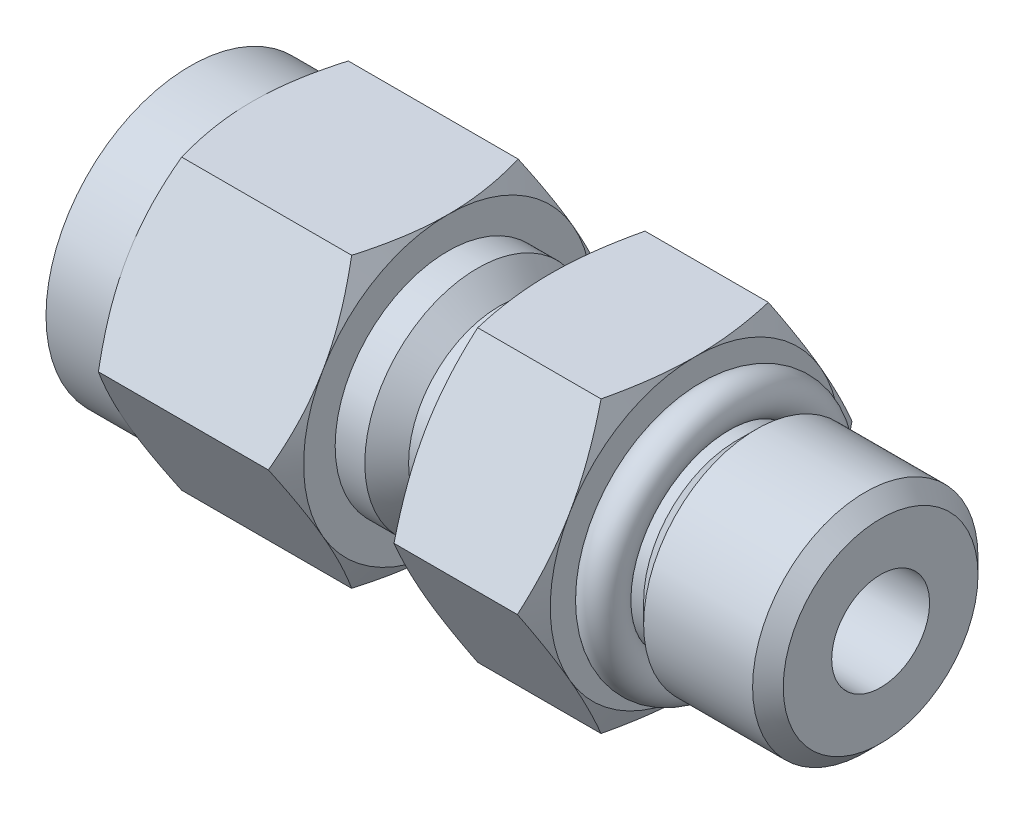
ISO-10303-21;
HEADER;
FILE_DESCRIPTION(('STEP AP214'),'2;1');
FILE_NAME('part.step','',(''),(''),'','','');
FILE_SCHEMA(('AUTOMOTIVE_DESIGN { 1 0 10303 214 1 1 1 1 }'));
ENDSEC;
DATA;
#1=APPLICATION_CONTEXT('core data for automotive mechanical design processes');
#2=APPLICATION_PROTOCOL_DEFINITION('international standard','automotive_design',2000,#1);
#3=PRODUCT_CONTEXT('',#1,'mechanical');
#4=PRODUCT('Part','Part','',(#3));
#5=PRODUCT_RELATED_PRODUCT_CATEGORY('part','',(#4));
#6=PRODUCT_DEFINITION_FORMATION('','',#4);
#7=PRODUCT_DEFINITION_CONTEXT('part definition',#1,'design');
#8=PRODUCT_DEFINITION('design','',#6,#7);
#9=PRODUCT_DEFINITION_SHAPE('','',#8);
#10=(LENGTH_UNIT() NAMED_UNIT(*) SI_UNIT(.MILLI.,.METRE.));
#11=(NAMED_UNIT(*) PLANE_ANGLE_UNIT() SI_UNIT($,.RADIAN.));
#12=(NAMED_UNIT(*) SI_UNIT($,.STERADIAN.) SOLID_ANGLE_UNIT());
#13=UNCERTAINTY_MEASURE_WITH_UNIT(LENGTH_MEASURE(1.E-05),#10,'distance_accuracy_value','');
#14=(GEOMETRIC_REPRESENTATION_CONTEXT(3) GLOBAL_UNCERTAINTY_ASSIGNED_CONTEXT((#13)) GLOBAL_UNIT_ASSIGNED_CONTEXT((#10,
#11,#12)) REPRESENTATION_CONTEXT('',''));
#15=CARTESIAN_POINT('',(0.,0.,0.));
#16=DIRECTION('',(0.,0.,1.));
#17=DIRECTION('',(1.,0.,0.));
#18=AXIS2_PLACEMENT_3D('',#15,#16,#17);
#19=CARTESIAN_POINT('',(-21.336,-7.112,4.10611511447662));
#20=DIRECTION('',(0.,-1.,0.));
#21=DIRECTION('',(0.,0.,-1.));
#22=AXIS2_PLACEMENT_3D('',#19,#20,#21);
#23=PLANE('',#22);
#24=DIRECTION('',(1.,0.,0.));
#25=VECTOR('',#24,1.);
#26=CARTESIAN_POINT('',(-21.336,-7.112,4.10611511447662));
#27=LINE('',#26,#25);
#28=CARTESIAN_POINT('',(-30.3527817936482,-7.11199996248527,4.10611513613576));
#29=VERTEX_POINT('',#28);
#30=CARTESIAN_POINT('',(-21.9712182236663,-7.112,4.10611513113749));
#31=VERTEX_POINT('',#30);
#32=EDGE_CURVE('E241',#29,#31,#27,.T.);
#33=ORIENTED_EDGE('',*,*,#32,.F.);
#34=CARTESIAN_POINT('',(-30.3527817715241,-7.112,4.10611514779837));
#35=CARTESIAN_POINT('',(-30.4492916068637,-7.112,3.77187912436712));
#36=CARTESIAN_POINT('',(-30.537711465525,-7.112,3.43496641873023));
#37=CARTESIAN_POINT('',(-30.6936382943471,-7.112,2.75817115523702));
#38=CARTESIAN_POINT('',(-30.7612486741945,-7.112,2.41831220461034));
#39=CARTESIAN_POINT('',(-30.8442627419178,-7.112,1.90531633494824));
#40=CARTESIAN_POINT('',(-30.8688772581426,-7.112,1.733669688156));
#41=CARTESIAN_POINT('',(-30.911485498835,-7.112,1.38955465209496));
#42=CARTESIAN_POINT('',(-30.9294793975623,-7.112,1.21708628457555));
#43=CARTESIAN_POINT('',(-30.9585302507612,-7.112,0.87068986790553));
#44=CARTESIAN_POINT('',(-30.9695519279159,-7.112,0.6967588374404));
#45=CARTESIAN_POINT('',(-30.9843020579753,-7.112,0.348554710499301));
#46=CARTESIAN_POINT('',(-30.9880290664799,-7.112,0.174281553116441));
#47=CARTESIAN_POINT('',(-30.988,-7.112,0.));
#48=B_SPLINE_CURVE_WITH_KNOTS('',3,(#34,#35,#36,#37,#38,#39,#40,#41,#42,#43,#44,#45,#46,#47),
.UNSPECIFIED.,.F.,.F.,(4,2,2,2,2,2,4),(0.,1.04409375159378,2.08291198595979,2.60300267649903,
3.12307967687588,3.64576749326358,4.16855879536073),.UNSPECIFIED.);
#49=CARTESIAN_POINT('',(-30.988,-7.112,0.));
#50=VERTEX_POINT('',#49);
#51=EDGE_CURVE('E784',#29,#50,#48,.T.);
#52=ORIENTED_EDGE('',*,*,#51,.T.);
#53=CARTESIAN_POINT('',(-30.988,-7.112,0.));
#54=CARTESIAN_POINT('',(-30.9880290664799,-7.112,-0.174281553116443));
#55=CARTESIAN_POINT('',(-30.9843020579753,-7.112,-0.348554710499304));
#56=CARTESIAN_POINT('',(-30.9695519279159,-7.112,-0.696758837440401));
#57=CARTESIAN_POINT('',(-30.9585302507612,-7.112,-0.870689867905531));
#58=CARTESIAN_POINT('',(-30.9294793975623,-7.112,-1.21708628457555));
#59=CARTESIAN_POINT('',(-30.911485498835,-7.112,-1.38955465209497));
#60=CARTESIAN_POINT('',(-30.8688772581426,-7.112,-1.733669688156));
#61=CARTESIAN_POINT('',(-30.8442627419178,-7.112,-1.90531633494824));
#62=CARTESIAN_POINT('',(-30.7612486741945,-7.112,-2.41831220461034));
#63=CARTESIAN_POINT('',(-30.6936382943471,-7.112,-2.75817115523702));
#64=CARTESIAN_POINT('',(-30.537711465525,-7.112,-3.43496641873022));
#65=CARTESIAN_POINT('',(-30.4492916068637,-7.112,-3.77187912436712));
#66=CARTESIAN_POINT('',(-30.3527817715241,-7.112,-4.10611514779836));
#67=B_SPLINE_CURVE_WITH_KNOTS('',3,(#53,#54,#55,#56,#57,#58,#59,#60,#61,#62,#63,#64,#65,#66),
.UNSPECIFIED.,.F.,.F.,(4,2,2,2,2,2,4),(0.,0.522791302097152,1.04547911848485,1.56555611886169,
2.08564680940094,3.12446504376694,4.16855879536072),.UNSPECIFIED.);
#68=CARTESIAN_POINT('',(-30.3527817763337,-7.11199999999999,-4.10611513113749));
#69=VERTEX_POINT('',#68);
#70=EDGE_CURVE('E785',#50,#69,#67,.T.);
#71=ORIENTED_EDGE('',*,*,#70,.T.);
#72=DIRECTION('',(1.,0.,0.));
#73=VECTOR('',#72,1.);
#74=CARTESIAN_POINT('',(-21.336,-7.11199999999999,-4.10611511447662));
#75=LINE('',#74,#73);
#76=CARTESIAN_POINT('',(-21.9712182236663,-7.11200001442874,-4.10611510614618));
#77=VERTEX_POINT('',#76);
#78=EDGE_CURVE('E256',#77,#69,#75,.F.);
#79=ORIENTED_EDGE('',*,*,#78,.F.);
#80=CARTESIAN_POINT('',(-21.9712181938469,-7.112,-4.10611502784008));
#81=CARTESIAN_POINT('',(-21.8747083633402,-7.112,-3.77187901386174));
#82=CARTESIAN_POINT('',(-21.7862885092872,-7.112,-3.43496631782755));
#83=CARTESIAN_POINT('',(-21.630361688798,-7.112,-2.75817107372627));
#84=CARTESIAN_POINT('',(-21.5627513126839,-7.112,-2.41831213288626));
#85=CARTESIAN_POINT('',(-21.4797372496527,-7.112,-1.90531627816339));
#86=CARTESIAN_POINT('',(-21.4551227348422,-7.112,-1.73366963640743));
#87=CARTESIAN_POINT('',(-21.4125144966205,-7.112,-1.38955461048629));
#88=CARTESIAN_POINT('',(-21.3945205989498,-7.112,-1.21708624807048));
#89=CARTESIAN_POINT('',(-21.3654697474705,-7.112,-0.870689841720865));
#90=CARTESIAN_POINT('',(-21.3544480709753,-7.112,-0.696758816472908));
#91=CARTESIAN_POINT('',(-21.3396979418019,-7.112,-0.348554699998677));
#92=CARTESIAN_POINT('',(-21.3359709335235,-7.112,-0.174281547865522));
#93=CARTESIAN_POINT('',(-21.336,-7.112,0.));
#94=B_SPLINE_CURVE_WITH_KNOTS('',3,(#80,#81,#82,#83,#84,#85,#86,#87,#88,#89,#90,#91,#92,#93),
.UNSPECIFIED.,.F.,.F.,(4,2,2,2,2,2,4),(0.,1.0440937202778,2.08291192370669,2.60300259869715,
3.12307958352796,3.64576738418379,4.16855867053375),.UNSPECIFIED.);
#95=CARTESIAN_POINT('',(-21.336,-7.112,0.));
#96=VERTEX_POINT('',#95);
#97=EDGE_CURVE('E743',#77,#96,#94,.T.);
#98=ORIENTED_EDGE('',*,*,#97,.T.);
#99=CARTESIAN_POINT('',(-21.336,-7.112,0.));
#100=CARTESIAN_POINT('',(-21.3359709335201,-7.112,0.174281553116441));
#101=CARTESIAN_POINT('',(-21.3396979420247,-7.112,0.348554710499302));
#102=CARTESIAN_POINT('',(-21.3544480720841,-7.112,0.6967588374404));
#103=CARTESIAN_POINT('',(-21.3654697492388,-7.112,0.87068986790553));
#104=CARTESIAN_POINT('',(-21.3945206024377,-7.112,1.21708628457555));
#105=CARTESIAN_POINT('',(-21.412514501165,-7.112,1.38955465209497));
#106=CARTESIAN_POINT('',(-21.4551227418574,-7.112,1.733669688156));
#107=CARTESIAN_POINT('',(-21.4797372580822,-7.112,1.90531633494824));
#108=CARTESIAN_POINT('',(-21.5627513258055,-7.112,2.41831220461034));
#109=CARTESIAN_POINT('',(-21.6303617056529,-7.112,2.75817115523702));
#110=CARTESIAN_POINT('',(-21.786288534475,-7.112,3.43496641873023));
#111=CARTESIAN_POINT('',(-21.8747083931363,-7.112,3.77187912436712));
#112=CARTESIAN_POINT('',(-21.9712182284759,-7.112,4.10611514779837));
#113=B_SPLINE_CURVE_WITH_KNOTS('',3,(#99,#100,#101,#102,#103,#104,#105,#106,#107,#108,#109,#110,
#111,#112),.UNSPECIFIED.,.F.,.F.,(4,2,2,2,2,2,4),(0.,0.522791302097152,1.04547911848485,
1.5655561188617,2.08564680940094,3.12446504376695,4.16855879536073),.UNSPECIFIED.);
#114=EDGE_CURVE('E748',#96,#31,#113,.T.);
#115=ORIENTED_EDGE('',*,*,#114,.T.);
#116=EDGE_LOOP('',(#33,#52,#71,#79,#98,#115));
#117=FACE_BOUND('',#116,.T.);
#118=ADVANCED_FACE('F16',(#117),#23,.T.);
#119=CARTESIAN_POINT('',(-21.336,0.,8.21223022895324));
#120=DIRECTION('',(0.,-0.500000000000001,0.866025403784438));
#121=DIRECTION('',(0.,-0.866025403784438,-0.500000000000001));
#122=AXIS2_PLACEMENT_3D('',#119,#120,#121);
#123=PLANE('',#122);
#124=CARTESIAN_POINT('',(-21.336,-3.55600000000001,6.15917267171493));
#125=CARTESIAN_POINT('',(-21.3359709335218,-3.40506774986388,6.24631344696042));
#126=CARTESIAN_POINT('',(-21.3396979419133,-3.25414277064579,6.33345002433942));
#127=CARTESIAN_POINT('',(-21.3544480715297,-2.9525891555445,6.50755208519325));
#128=CARTESIAN_POINT('',(-21.3654697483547,-2.80196046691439,6.59451759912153));
#129=CARTESIAN_POINT('',(-21.3945206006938,-2.50197237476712,6.76771580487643));
#130=CARTESIAN_POINT('',(-21.4125144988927,-2.352610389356,6.85394998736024));
#131=CARTESIAN_POINT('',(-21.4551227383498,-2.05459803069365,7.02600750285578));
#132=CARTESIAN_POINT('',(-21.4797372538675,-1.90594767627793,7.11183082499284));
#133=CARTESIAN_POINT('',(-21.5627513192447,-1.46168022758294,7.36832875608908));
#134=CARTESIAN_POINT('',(-21.6303616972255,-1.16735374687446,7.53825822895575));
#135=CARTESIAN_POINT('',(-21.7862885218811,-0.581231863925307,7.87665585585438));
#136=CARTESIAN_POINT('',(-21.8747083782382,-0.289456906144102,8.04511220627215));
#137=CARTESIAN_POINT('',(-21.9712182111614,-2.30859826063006E-08,8.21223021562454));
#138=B_SPLINE_CURVE_WITH_KNOTS('',3,(#124,#125,#126,#127,#128,#129,#130,#131,#132,#133,#134,
#135,#136,#137),.UNSPECIFIED.,.F.,.F.,(4,2,2,2,2,2,4),(0.,0.522791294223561,1.04547910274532,
1.56555609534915,2.08564677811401,3.12446499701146,4.16855873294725),.UNSPECIFIED.);
#139=CARTESIAN_POINT('',(-21.336,-3.55600000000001,6.15917267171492));
#140=VERTEX_POINT('',#139);
#141=CARTESIAN_POINT('',(-21.9712182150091,-1.15429933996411E-08,8.21223022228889));
#142=VERTEX_POINT('',#141);
#143=EDGE_CURVE('E244',#140,#142,#138,.T.);
#144=ORIENTED_EDGE('',*,*,#143,.T.);
#145=DIRECTION('',(1.,0.,0.));
#146=VECTOR('',#145,1.);
#147=CARTESIAN_POINT('',(-21.336,0.,8.21223022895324));
#148=LINE('',#147,#146);
#149=CARTESIAN_POINT('',(-30.3527817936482,3.75147266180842E-08,8.2122302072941));
#150=VERTEX_POINT('',#149);
#151=EDGE_CURVE('E229',#150,#142,#148,.T.);
#152=ORIENTED_EDGE('',*,*,#151,.F.);
#153=CARTESIAN_POINT('',(-30.3527817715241,2.88574779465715E-08,8.21223024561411));
#154=CARTESIAN_POINT('',(-30.4492916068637,-0.289456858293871,8.04511223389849));
#155=CARTESIAN_POINT('',(-30.537711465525,-0.581231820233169,7.87665588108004));
#156=CARTESIAN_POINT('',(-30.6936382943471,-1.16735371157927,7.53825824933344));
#157=CARTESIAN_POINT('',(-30.7612486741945,-1.4616801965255,7.3683287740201));
#158=CARTESIAN_POINT('',(-30.8442627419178,-1.90594765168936,7.11183083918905));
#159=CARTESIAN_POINT('',(-30.8688772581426,-2.05459800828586,7.02600751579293));
#160=CARTESIAN_POINT('',(-30.911485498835,-2.35261037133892,6.85394999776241));
#161=CARTESIAN_POINT('',(-30.9294793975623,-2.50197235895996,6.7677158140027));
#162=CARTESIAN_POINT('',(-30.9585302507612,-2.8019604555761,6.59451760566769));
#163=CARTESIAN_POINT('',(-30.9695519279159,-2.95258914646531,6.50755209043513));
#164=CARTESIAN_POINT('',(-30.9843020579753,-3.25414276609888,6.33345002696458));
#165=CARTESIAN_POINT('',(-30.9880290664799,-3.40506774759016,6.24631344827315));
#166=CARTESIAN_POINT('',(-30.988,-3.55600000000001,6.15917267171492));
#167=B_SPLINE_CURVE_WITH_KNOTS('',3,(#153,#154,#155,#156,#157,#158,#159,#160,#161,#162,#163,
#164,#165,#166),.UNSPECIFIED.,.F.,.F.,(4,2,2,2,2,2,4),(0.,1.04409375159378,2.08291198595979,
2.60300267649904,3.12307967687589,3.64576749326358,4.16855879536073),.UNSPECIFIED.);
#168=CARTESIAN_POINT('',(-30.988,-3.556,6.15917267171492));
#169=VERTEX_POINT('',#168);
#170=EDGE_CURVE('E769',#150,#169,#167,.T.);
#171=ORIENTED_EDGE('',*,*,#170,.T.);
#172=CARTESIAN_POINT('',(-30.988,-3.556,6.15917267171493));
#173=CARTESIAN_POINT('',(-30.9880290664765,-3.70693224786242,6.07203189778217));
#174=CARTESIAN_POINT('',(-30.9843020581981,-3.85785722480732,5.98489532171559));
#175=CARTESIAN_POINT('',(-30.9695519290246,-4.15941083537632,5.81079326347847));
#176=CARTESIAN_POINT('',(-30.9585302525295,-4.31003952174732,5.7238277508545));
#177=CARTESIAN_POINT('',(-30.9294794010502,-4.61002760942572,5.55062954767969));
#178=CARTESIAN_POINT('',(-30.9114855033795,-4.75938959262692,5.46439536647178));
#179=CARTESIAN_POINT('',(-30.8688772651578,-5.05740194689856,5.29233785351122));
#180=CARTESIAN_POINT('',(-30.8442627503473,-5.20605229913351,5.20651453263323));
#181=CARTESIAN_POINT('',(-30.7612486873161,-5.65031974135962,4.9500166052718));
#182=CARTESIAN_POINT('',(-30.6936383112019,-5.94464621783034,4.7800871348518));
#183=CARTESIAN_POINT('',(-30.5377114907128,-6.53076809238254,4.44168951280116));
#184=CARTESIAN_POINT('',(-30.4492916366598,-6.82254304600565,4.27323316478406));
#185=CARTESIAN_POINT('',(-30.3527818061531,-7.11199992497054,4.1061151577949));
#186=B_SPLINE_CURVE_WITH_KNOTS('',3,(#172,#173,#174,#175,#176,#177,#178,#179,#180,#181,#182,
#183,#184,#185),.UNSPECIFIED.,.F.,.F.,(4,2,2,2,2,2,4),(0.,0.522791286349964,1.04547908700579,
1.56555607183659,2.08564674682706,3.12446495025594,4.16855867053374),.UNSPECIFIED.);
#187=EDGE_CURVE('E777',#169,#29,#186,.T.);
#188=ORIENTED_EDGE('',*,*,#187,.T.);
#189=ORIENTED_EDGE('',*,*,#32,.T.);
#190=CARTESIAN_POINT('',(-21.9712181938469,-7.11199992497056,4.10611515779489));
#191=CARTESIAN_POINT('',(-21.8747083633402,-6.82254304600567,4.27323316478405));
#192=CARTESIAN_POINT('',(-21.7862885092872,-6.53076809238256,4.44168951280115));
#193=CARTESIAN_POINT('',(-21.6303616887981,-5.94464621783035,4.78008713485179));
#194=CARTESIAN_POINT('',(-21.5627513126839,-5.65031974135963,4.9500166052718));
#195=CARTESIAN_POINT('',(-21.4797372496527,-5.20605229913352,5.20651453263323));
#196=CARTESIAN_POINT('',(-21.4551227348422,-5.05740194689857,5.29233785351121));
#197=CARTESIAN_POINT('',(-21.4125144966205,-4.75938959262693,5.46439536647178));
#198=CARTESIAN_POINT('',(-21.3945205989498,-4.61002760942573,5.55062954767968));
#199=CARTESIAN_POINT('',(-21.3654697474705,-4.31003952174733,5.72382775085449));
#200=CARTESIAN_POINT('',(-21.3544480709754,-4.15941083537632,5.81079326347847));
#201=CARTESIAN_POINT('',(-21.3396979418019,-3.85785722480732,5.98489532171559));
#202=CARTESIAN_POINT('',(-21.3359709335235,-3.70693224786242,6.07203189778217));
#203=CARTESIAN_POINT('',(-21.336,-3.55600000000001,6.15917267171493));
#204=B_SPLINE_CURVE_WITH_KNOTS('',3,(#190,#191,#192,#193,#194,#195,#196,#197,#198,#199,#200,
#201,#202,#203),.UNSPECIFIED.,.F.,.F.,(4,2,2,2,2,2,4),(0.,1.0440937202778,2.08291192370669,
2.60300259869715,3.12307958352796,3.64576738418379,4.16855867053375),.UNSPECIFIED.);
#205=EDGE_CURVE('E247',#31,#140,#204,.T.);
#206=ORIENTED_EDGE('',*,*,#205,.T.);
#207=EDGE_LOOP('',(#144,#152,#171,#188,#189,#206));
#208=FACE_BOUND('',#207,.T.);
#209=ADVANCED_FACE('F245',(#208),#123,.T.);
#210=CARTESIAN_POINT('',(-21.336,7.112,4.10611511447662));
#211=DIRECTION('',(0.,0.5,0.866025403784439));
#212=DIRECTION('',(0.,-0.866025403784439,0.5));
#213=AXIS2_PLACEMENT_3D('',#210,#211,#212);
#214=PLANE('',#213);
#215=DIRECTION('',(1.,0.,0.));
#216=VECTOR('',#215,1.);
#217=CARTESIAN_POINT('',(-21.336,7.112,4.10611511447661));
#218=LINE('',#217,#216);
#219=CARTESIAN_POINT('',(-30.3527817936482,7.112,4.10611507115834));
#220=VERTEX_POINT('',#219);
#221=CARTESIAN_POINT('',(-21.9712182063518,7.11199996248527,4.10611513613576));
#222=VERTEX_POINT('',#221);
#223=EDGE_CURVE('E240',#220,#222,#218,.T.);
#224=ORIENTED_EDGE('',*,*,#223,.F.);
#225=CARTESIAN_POINT('',(-30.3527817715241,7.11200002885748,4.10611509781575));
#226=CARTESIAN_POINT('',(-30.4492916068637,6.82254314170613,4.27323310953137));
#227=CARTESIAN_POINT('',(-30.537711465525,6.53076817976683,4.44168946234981));
#228=CARTESIAN_POINT('',(-30.6936382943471,5.94464628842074,4.78008709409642));
#229=CARTESIAN_POINT('',(-30.7612486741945,5.65031980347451,4.95001656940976));
#230=CARTESIAN_POINT('',(-30.8442627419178,5.20605234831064,5.20651450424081));
#231=CARTESIAN_POINT('',(-30.8688772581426,5.05740199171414,5.29233782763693));
#232=CARTESIAN_POINT('',(-30.911485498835,4.75938962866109,5.46439534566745));
#233=CARTESIAN_POINT('',(-30.9294793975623,4.61002764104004,5.55062952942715));
#234=CARTESIAN_POINT('',(-30.9585302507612,4.31003954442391,5.72382773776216));
#235=CARTESIAN_POINT('',(-30.9695519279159,4.1594108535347,5.81079325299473));
#236=CARTESIAN_POINT('',(-30.9843020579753,3.85785723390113,5.98489531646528));
#237=CARTESIAN_POINT('',(-30.9880290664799,3.70693225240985,6.07203189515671));
#238=CARTESIAN_POINT('',(-30.988,3.556,6.15917267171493));
#239=B_SPLINE_CURVE_WITH_KNOTS('',3,(#225,#226,#227,#228,#229,#230,#231,#232,#233,#234,#235,
#236,#237,#238),.UNSPECIFIED.,.F.,.F.,(4,2,2,2,2,2,4),(0.,1.04409375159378,2.08291198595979,
2.60300267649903,3.12307967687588,3.64576749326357,4.16855879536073),.UNSPECIFIED.);
#240=CARTESIAN_POINT('',(-30.988,3.556,6.15917267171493));
#241=VERTEX_POINT('',#240);
#242=EDGE_CURVE('E1424',#220,#241,#239,.T.);
#243=ORIENTED_EDGE('',*,*,#242,.T.);
#244=CARTESIAN_POINT('',(-30.988,3.556,6.15917267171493));
#245=CARTESIAN_POINT('',(-30.9880290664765,3.40506775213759,6.24631344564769));
#246=CARTESIAN_POINT('',(-30.9843020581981,3.25414277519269,6.33345002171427));
#247=CARTESIAN_POINT('',(-30.9695519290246,2.95258916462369,6.50755207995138));
#248=CARTESIAN_POINT('',(-30.9585302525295,2.80196047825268,6.59451759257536));
#249=CARTESIAN_POINT('',(-30.9294794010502,2.50197239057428,6.76771579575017));
#250=CARTESIAN_POINT('',(-30.9114855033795,2.35261040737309,6.85394997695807));
#251=CARTESIAN_POINT('',(-30.8688772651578,2.05459805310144,7.02600748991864));
#252=CARTESIAN_POINT('',(-30.8442627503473,1.90594770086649,7.11183081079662));
#253=CARTESIAN_POINT('',(-30.7612486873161,1.46168025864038,7.36832873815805));
#254=CARTESIAN_POINT('',(-30.6936383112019,1.16735378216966,7.53825820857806));
#255=CARTESIAN_POINT('',(-30.5377114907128,0.581231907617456,7.8766558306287));
#256=CARTESIAN_POINT('',(-30.4492916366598,0.289456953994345,8.04511217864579));
#257=CARTESIAN_POINT('',(-30.3527818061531,7.50294590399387E-08,8.21223018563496));
#258=B_SPLINE_CURVE_WITH_KNOTS('',3,(#244,#245,#246,#247,#248,#249,#250,#251,#252,#253,#254,
#255,#256,#257),.UNSPECIFIED.,.F.,.F.,(4,2,2,2,2,2,4),(0.,0.522791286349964,1.04547908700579,
1.5655560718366,2.08564674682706,3.12446495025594,4.16855867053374),.UNSPECIFIED.);
#259=EDGE_CURVE('E235',#241,#150,#258,.T.);
#260=ORIENTED_EDGE('',*,*,#259,.T.);
#261=ORIENTED_EDGE('',*,*,#151,.T.);
#262=CARTESIAN_POINT('',(-21.9712182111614,2.30859815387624E-08,8.21223021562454));
#263=CARTESIAN_POINT('',(-21.8747083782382,0.2894569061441,8.04511220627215));
#264=CARTESIAN_POINT('',(-21.7862885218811,0.581231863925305,7.87665585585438));
#265=CARTESIAN_POINT('',(-21.6303616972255,1.16735374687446,7.53825822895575));
#266=CARTESIAN_POINT('',(-21.5627513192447,1.46168022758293,7.36832875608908));
#267=CARTESIAN_POINT('',(-21.4797372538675,1.90594767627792,7.11183082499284));
#268=CARTESIAN_POINT('',(-21.4551227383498,2.05459803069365,7.02600750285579));
#269=CARTESIAN_POINT('',(-21.4125144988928,2.352610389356,6.85394998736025));
#270=CARTESIAN_POINT('',(-21.3945206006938,2.50197237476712,6.76771580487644));
#271=CARTESIAN_POINT('',(-21.3654697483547,2.80196046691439,6.59451759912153));
#272=CARTESIAN_POINT('',(-21.3544480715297,2.95258915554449,6.50755208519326));
#273=CARTESIAN_POINT('',(-21.3396979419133,3.25414277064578,6.33345002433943));
#274=CARTESIAN_POINT('',(-21.3359709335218,3.40506774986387,6.24631344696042));
#275=CARTESIAN_POINT('',(-21.336,3.556,6.15917267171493));
#276=B_SPLINE_CURVE_WITH_KNOTS('',3,(#262,#263,#264,#265,#266,#267,#268,#269,#270,#271,#272,
#273,#274,#275),.UNSPECIFIED.,.F.,.F.,(4,2,2,2,2,2,4),(0.,1.04409373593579,2.08291195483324,
2.60300263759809,3.12307963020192,3.64576743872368,4.16855873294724),.UNSPECIFIED.);
#277=CARTESIAN_POINT('',(-21.336,3.556,6.15917267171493));
#278=VERTEX_POINT('',#277);
#279=EDGE_CURVE('E20',#142,#278,#276,.T.);
#280=ORIENTED_EDGE('',*,*,#279,.T.);
#281=CARTESIAN_POINT('',(-21.336,3.556,6.15917267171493));
#282=CARTESIAN_POINT('',(-21.3359709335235,3.70693224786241,6.07203189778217));
#283=CARTESIAN_POINT('',(-21.339697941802,3.85785722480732,5.98489532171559));
#284=CARTESIAN_POINT('',(-21.3544480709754,4.15941083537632,5.81079326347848));
#285=CARTESIAN_POINT('',(-21.3654697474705,4.31003952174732,5.7238277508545));
#286=CARTESIAN_POINT('',(-21.3945205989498,4.61002760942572,5.55062954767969));
#287=CARTESIAN_POINT('',(-21.4125144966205,4.75938959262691,5.46439536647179));
#288=CARTESIAN_POINT('',(-21.4551227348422,5.05740194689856,5.29233785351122));
#289=CARTESIAN_POINT('',(-21.4797372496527,5.20605229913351,5.20651453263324));
#290=CARTESIAN_POINT('',(-21.5627513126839,5.65031974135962,4.95001660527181));
#291=CARTESIAN_POINT('',(-21.6303616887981,5.94464621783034,4.7800871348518));
#292=CARTESIAN_POINT('',(-21.7862885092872,6.53076809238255,4.44168951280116));
#293=CARTESIAN_POINT('',(-21.8747083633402,6.82254304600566,4.27323316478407));
#294=CARTESIAN_POINT('',(-21.9712181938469,7.11199992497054,4.1061151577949));
#295=B_SPLINE_CURVE_WITH_KNOTS('',3,(#281,#282,#283,#284,#285,#286,#287,#288,#289,#290,#291,
#292,#293,#294),.UNSPECIFIED.,.F.,.F.,(4,2,2,2,2,2,4),(0.,0.522791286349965,1.04547908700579,
1.5655560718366,2.08564674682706,3.12446495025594,4.16855867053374),.UNSPECIFIED.);
#296=EDGE_CURVE('E815',#278,#222,#295,.T.);
#297=ORIENTED_EDGE('',*,*,#296,.T.);
#298=EDGE_LOOP('',(#224,#243,#260,#261,#280,#297));
#299=FACE_BOUND('',#298,.T.);
#300=ADVANCED_FACE('F231',(#299),#214,.T.);
#301=CARTESIAN_POINT('',(-21.336,7.112,0.));
#302=DIRECTION('',(0.,1.,0.));
#303=DIRECTION('',(0.,0.,1.));
#304=AXIS2_PLACEMENT_3D('',#301,#302,#303);
#305=PLANE('',#304);
#306=DIRECTION('',(1.,0.,0.));
#307=VECTOR('',#306,1.);
#308=CARTESIAN_POINT('',(-21.336,7.112,-4.10611511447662));
#309=LINE('',#308,#307);
#310=CARTESIAN_POINT('',(-30.3527817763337,7.11200001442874,-4.10611510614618));
#311=VERTEX_POINT('',#310);
#312=CARTESIAN_POINT('',(-21.9712182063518,7.112,-4.10611507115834));
#313=VERTEX_POINT('',#312);
#314=EDGE_CURVE('E271',#311,#313,#309,.T.);
#315=ORIENTED_EDGE('',*,*,#314,.F.);
#316=CARTESIAN_POINT('',(-30.3527818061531,7.112,-4.10611502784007));
#317=CARTESIAN_POINT('',(-30.4492916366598,7.112,-3.77187901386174));
#318=CARTESIAN_POINT('',(-30.5377114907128,7.112,-3.43496631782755));
#319=CARTESIAN_POINT('',(-30.6936383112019,7.112,-2.75817107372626));
#320=CARTESIAN_POINT('',(-30.7612486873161,7.112,-2.41831213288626));
#321=CARTESIAN_POINT('',(-30.8442627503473,7.112,-1.90531627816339));
#322=CARTESIAN_POINT('',(-30.8688772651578,7.112,-1.73366963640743));
#323=CARTESIAN_POINT('',(-30.9114855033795,7.112,-1.38955461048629));
#324=CARTESIAN_POINT('',(-30.9294794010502,7.112,-1.21708624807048));
#325=CARTESIAN_POINT('',(-30.9585302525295,7.112,-0.870689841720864));
#326=CARTESIAN_POINT('',(-30.9695519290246,7.112,-0.696758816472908));
#327=CARTESIAN_POINT('',(-30.984302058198,7.112,-0.348554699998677));
#328=CARTESIAN_POINT('',(-30.9880290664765,7.112,-0.174281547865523));
#329=CARTESIAN_POINT('',(-30.988,7.112,0.));
#330=B_SPLINE_CURVE_WITH_KNOTS('',3,(#316,#317,#318,#319,#320,#321,#322,#323,#324,#325,#326,
#327,#328,#329),.UNSPECIFIED.,.F.,.F.,(4,2,2,2,2,2,4),(0.,1.0440937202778,2.08291192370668,
2.60300259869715,3.12307958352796,3.64576738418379,4.16855867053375),.UNSPECIFIED.);
#331=CARTESIAN_POINT('',(-30.988,7.112,0.));
#332=VERTEX_POINT('',#331);
#333=EDGE_CURVE('E1550',#311,#332,#330,.T.);
#334=ORIENTED_EDGE('',*,*,#333,.T.);
#335=CARTESIAN_POINT('',(-30.988,7.112,0.));
#336=CARTESIAN_POINT('',(-30.9880290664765,7.112,0.174281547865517));
#337=CARTESIAN_POINT('',(-30.9843020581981,7.112,0.348554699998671));
#338=CARTESIAN_POINT('',(-30.9695519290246,7.112,0.696758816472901));
#339=CARTESIAN_POINT('',(-30.9585302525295,7.112,0.870689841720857));
#340=CARTESIAN_POINT('',(-30.9294794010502,7.112,1.21708624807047));
#341=CARTESIAN_POINT('',(-30.9114855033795,7.112,1.38955461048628));
#342=CARTESIAN_POINT('',(-30.8688772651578,7.112,1.73366963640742));
#343=CARTESIAN_POINT('',(-30.8442627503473,7.112,1.90531627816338));
#344=CARTESIAN_POINT('',(-30.7612486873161,7.112,2.41831213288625));
#345=CARTESIAN_POINT('',(-30.6936383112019,7.112,2.75817107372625));
#346=CARTESIAN_POINT('',(-30.5377114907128,7.112,3.43496631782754));
#347=CARTESIAN_POINT('',(-30.4492916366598,7.112,3.77187901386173));
#348=CARTESIAN_POINT('',(-30.3527818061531,7.112,4.10611502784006));
#349=B_SPLINE_CURVE_WITH_KNOTS('',3,(#335,#336,#337,#338,#339,#340,#341,#342,#343,#344,#345,
#346,#347,#348),.UNSPECIFIED.,.F.,.F.,(4,2,2,2,2,2,4),(0.,0.522791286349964,1.04547908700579,
1.5655560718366,2.08564674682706,3.12446495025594,4.16855867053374),.UNSPECIFIED.);
#350=EDGE_CURVE('E1426',#332,#220,#349,.T.);
#351=ORIENTED_EDGE('',*,*,#350,.T.);
#352=ORIENTED_EDGE('',*,*,#223,.T.);
#353=CARTESIAN_POINT('',(-21.9712182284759,7.112,4.10611514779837));
#354=CARTESIAN_POINT('',(-21.8747083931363,7.112,3.77187912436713));
#355=CARTESIAN_POINT('',(-21.786288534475,7.112,3.43496641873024));
#356=CARTESIAN_POINT('',(-21.6303617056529,7.112,2.75817115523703));
#357=CARTESIAN_POINT('',(-21.5627513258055,7.112,2.41831220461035));
#358=CARTESIAN_POINT('',(-21.4797372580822,7.112,1.90531633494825));
#359=CARTESIAN_POINT('',(-21.4551227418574,7.112,1.733669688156));
#360=CARTESIAN_POINT('',(-21.412514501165,7.112,1.38955465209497));
#361=CARTESIAN_POINT('',(-21.3945206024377,7.112,1.21708628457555));
#362=CARTESIAN_POINT('',(-21.3654697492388,7.112,0.870689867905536));
#363=CARTESIAN_POINT('',(-21.3544480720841,7.112,0.696758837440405));
#364=CARTESIAN_POINT('',(-21.3396979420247,7.112,0.348554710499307));
#365=CARTESIAN_POINT('',(-21.3359709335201,7.112,0.174281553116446));
#366=CARTESIAN_POINT('',(-21.336,7.112,0.));
#367=B_SPLINE_CURVE_WITH_KNOTS('',3,(#353,#354,#355,#356,#357,#358,#359,#360,#361,#362,#363,
#364,#365,#366),.UNSPECIFIED.,.F.,.F.,(4,2,2,2,2,2,4),(0.,1.04409375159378,2.08291198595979,
2.60300267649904,3.12307967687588,3.64576749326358,4.16855879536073),.UNSPECIFIED.);
#368=CARTESIAN_POINT('',(-21.336,7.112,0.));
#369=VERTEX_POINT('',#368);
#370=EDGE_CURVE('E810',#222,#369,#367,.T.);
#371=ORIENTED_EDGE('',*,*,#370,.T.);
#372=CARTESIAN_POINT('',(-21.336,7.112,0.));
#373=CARTESIAN_POINT('',(-21.3359709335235,7.112,-0.174281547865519));
#374=CARTESIAN_POINT('',(-21.3396979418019,7.112,-0.348554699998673));
#375=CARTESIAN_POINT('',(-21.3544480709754,7.112,-0.696758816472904));
#376=CARTESIAN_POINT('',(-21.3654697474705,7.112,-0.870689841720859));
#377=CARTESIAN_POINT('',(-21.3945205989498,7.112,-1.21708624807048));
#378=CARTESIAN_POINT('',(-21.4125144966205,7.112,-1.38955461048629));
#379=CARTESIAN_POINT('',(-21.4551227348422,7.112,-1.73366963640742));
#380=CARTESIAN_POINT('',(-21.4797372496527,7.112,-1.90531627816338));
#381=CARTESIAN_POINT('',(-21.5627513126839,7.112,-2.41831213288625));
#382=CARTESIAN_POINT('',(-21.6303616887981,7.112,-2.75817107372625));
#383=CARTESIAN_POINT('',(-21.7862885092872,7.112,-3.43496631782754));
#384=CARTESIAN_POINT('',(-21.8747083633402,7.112,-3.77187901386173));
#385=CARTESIAN_POINT('',(-21.9712181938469,7.112,-4.10611502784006));
#386=B_SPLINE_CURVE_WITH_KNOTS('',3,(#372,#373,#374,#375,#376,#377,#378,#379,#380,#381,#382,
#383,#384,#385),.UNSPECIFIED.,.F.,.F.,(4,2,2,2,2,2,4),(0.,0.522791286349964,1.04547908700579,
1.5655560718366,2.08564674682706,3.12446495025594,4.16855867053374),.UNSPECIFIED.);
#387=EDGE_CURVE('E712',#369,#313,#386,.T.);
#388=ORIENTED_EDGE('',*,*,#387,.T.);
#389=EDGE_LOOP('',(#315,#334,#351,#352,#371,#388));
#390=FACE_BOUND('',#389,.T.);
#391=ADVANCED_FACE('F831',(#390),#305,.T.);
#392=CARTESIAN_POINT('',(-21.336,0.,-8.21223022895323));
#393=DIRECTION('',(0.,0.5,-0.866025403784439));
#394=DIRECTION('',(0.,0.866025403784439,0.5));
#395=AXIS2_PLACEMENT_3D('',#392,#393,#394);
#396=PLANE('',#395);
#397=CARTESIAN_POINT('',(-21.336,3.556,-6.15917267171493));
#398=CARTESIAN_POINT('',(-21.3359709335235,3.40506775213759,-6.24631344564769));
#399=CARTESIAN_POINT('',(-21.3396979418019,3.25414277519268,-6.33345002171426));
#400=CARTESIAN_POINT('',(-21.3544480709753,2.95258916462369,-6.50755207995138));
#401=CARTESIAN_POINT('',(-21.3654697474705,2.80196047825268,-6.59451759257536));
#402=CARTESIAN_POINT('',(-21.3945205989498,2.50197239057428,-6.76771579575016));
#403=CARTESIAN_POINT('',(-21.4125144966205,2.35261040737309,-6.85394997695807));
#404=CARTESIAN_POINT('',(-21.4551227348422,2.05459805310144,-7.02600748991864));
#405=CARTESIAN_POINT('',(-21.4797372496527,1.90594770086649,-7.11183081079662));
#406=CARTESIAN_POINT('',(-21.5627513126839,1.46168025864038,-7.36832873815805));
#407=CARTESIAN_POINT('',(-21.630361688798,1.16735378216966,-7.53825820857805));
#408=CARTESIAN_POINT('',(-21.7862885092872,0.581231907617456,-7.8766558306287));
#409=CARTESIAN_POINT('',(-21.8747083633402,0.289456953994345,-8.04511217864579));
#410=CARTESIAN_POINT('',(-21.9712181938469,7.50294592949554E-08,-8.21223018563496));
#411=B_SPLINE_CURVE_WITH_KNOTS('',3,(#397,#398,#399,#400,#401,#402,#403,#404,#405,#406,#407,
#408,#409,#410),.UNSPECIFIED.,.F.,.F.,(4,2,2,2,2,2,4),(0.,0.522791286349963,1.04547908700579,
1.56555607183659,2.08564674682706,3.12446495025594,4.16855867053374),.UNSPECIFIED.);
#412=CARTESIAN_POINT('',(-21.336,3.556,-6.15917267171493));
#413=VERTEX_POINT('',#412);
#414=CARTESIAN_POINT('',(-21.9712182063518,3.75147301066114E-08,-8.2122302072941));
#415=VERTEX_POINT('',#414);
#416=EDGE_CURVE('E713',#413,#415,#411,.T.);
#417=ORIENTED_EDGE('',*,*,#416,.T.);
#418=DIRECTION('',(1.,0.,0.));
#419=VECTOR('',#418,1.);
#420=CARTESIAN_POINT('',(-21.336,0.,-8.21223022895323));
#421=LINE('',#420,#419);
#422=CARTESIAN_POINT('',(-30.3527817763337,1.44287371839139E-08,-8.21223023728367));
#423=VERTEX_POINT('',#422);
#424=EDGE_CURVE('E261',#423,#415,#421,.T.);
#425=ORIENTED_EDGE('',*,*,#424,.F.);
#426=CARTESIAN_POINT('',(-30.3527818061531,7.50294464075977E-08,-8.21223018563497));
#427=CARTESIAN_POINT('',(-30.4492916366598,0.289456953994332,-8.0451121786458));
#428=CARTESIAN_POINT('',(-30.5377114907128,0.581231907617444,-7.87665583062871));
#429=CARTESIAN_POINT('',(-30.6936383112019,1.16735378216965,-7.53825820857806));
#430=CARTESIAN_POINT('',(-30.7612486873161,1.46168025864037,-7.36832873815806));
#431=CARTESIAN_POINT('',(-30.8442627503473,1.90594770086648,-7.11183081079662));
#432=CARTESIAN_POINT('',(-30.8688772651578,2.05459805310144,-7.02600748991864));
#433=CARTESIAN_POINT('',(-30.9114855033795,2.35261040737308,-6.85394997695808));
#434=CARTESIAN_POINT('',(-30.9294794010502,2.50197239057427,-6.76771579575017));
#435=CARTESIAN_POINT('',(-30.9585302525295,2.80196047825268,-6.59451759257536));
#436=CARTESIAN_POINT('',(-30.9695519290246,2.95258916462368,-6.50755207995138));
#437=CARTESIAN_POINT('',(-30.9843020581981,3.25414277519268,-6.33345002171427));
#438=CARTESIAN_POINT('',(-30.9880290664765,3.40506775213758,-6.24631344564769));
#439=CARTESIAN_POINT('',(-30.988,3.556,-6.15917267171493));
#440=B_SPLINE_CURVE_WITH_KNOTS('',3,(#426,#427,#428,#429,#430,#431,#432,#433,#434,#435,#436,
#437,#438,#439),.UNSPECIFIED.,.F.,.F.,(4,2,2,2,2,2,4),(0.,1.0440937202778,2.08291192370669,
2.60300259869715,3.12307958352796,3.64576738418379,4.16855867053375),.UNSPECIFIED.);
#441=CARTESIAN_POINT('',(-30.988,3.556,-6.15917267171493));
#442=VERTEX_POINT('',#441);
#443=EDGE_CURVE('E673',#423,#442,#440,.T.);
#444=ORIENTED_EDGE('',*,*,#443,.T.);
#445=CARTESIAN_POINT('',(-30.988,3.556,-6.15917267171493));
#446=CARTESIAN_POINT('',(-30.9880290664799,3.70693225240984,-6.07203189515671));
#447=CARTESIAN_POINT('',(-30.9843020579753,3.85785723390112,-5.98489531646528));
#448=CARTESIAN_POINT('',(-30.9695519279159,4.1594108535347,-5.81079325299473));
#449=CARTESIAN_POINT('',(-30.9585302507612,4.3100395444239,-5.72382773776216));
#450=CARTESIAN_POINT('',(-30.9294793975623,4.61002764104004,-5.55062952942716));
#451=CARTESIAN_POINT('',(-30.911485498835,4.75938962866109,-5.46439534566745));
#452=CARTESIAN_POINT('',(-30.8688772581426,5.05740199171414,-5.29233782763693));
#453=CARTESIAN_POINT('',(-30.8442627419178,5.20605234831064,-5.20651450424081));
#454=CARTESIAN_POINT('',(-30.7612486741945,5.6503198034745,-4.95001656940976));
#455=CARTESIAN_POINT('',(-30.6936382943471,5.94464628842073,-4.78008709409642));
#456=CARTESIAN_POINT('',(-30.537711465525,6.53076817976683,-4.44168946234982));
#457=CARTESIAN_POINT('',(-30.4492916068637,6.82254314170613,-4.27323310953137));
#458=CARTESIAN_POINT('',(-30.3527817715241,7.11200002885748,-4.10611509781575));
#459=B_SPLINE_CURVE_WITH_KNOTS('',3,(#445,#446,#447,#448,#449,#450,#451,#452,#453,#454,#455,
#456,#457,#458),.UNSPECIFIED.,.F.,.F.,(4,2,2,2,2,2,4),(0.,0.522791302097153,1.04547911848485,
1.5655561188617,2.08564680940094,3.12446504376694,4.16855879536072),.UNSPECIFIED.);
#460=EDGE_CURVE('E837',#442,#311,#459,.T.);
#461=ORIENTED_EDGE('',*,*,#460,.T.);
#462=ORIENTED_EDGE('',*,*,#314,.T.);
#463=CARTESIAN_POINT('',(-21.9712182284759,7.11200002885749,-4.10611509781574));
#464=CARTESIAN_POINT('',(-21.8747083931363,6.82254314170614,-4.27323310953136));
#465=CARTESIAN_POINT('',(-21.786288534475,6.53076817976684,-4.44168946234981));
#466=CARTESIAN_POINT('',(-21.6303617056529,5.94464628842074,-4.78008709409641));
#467=CARTESIAN_POINT('',(-21.5627513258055,5.65031980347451,-4.95001656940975));
#468=CARTESIAN_POINT('',(-21.4797372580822,5.20605234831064,-5.2065145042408));
#469=CARTESIAN_POINT('',(-21.4551227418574,5.05740199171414,-5.29233782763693));
#470=CARTESIAN_POINT('',(-21.4125145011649,4.75938962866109,-5.46439534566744));
#471=CARTESIAN_POINT('',(-21.3945206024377,4.61002764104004,-5.55062952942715));
#472=CARTESIAN_POINT('',(-21.3654697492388,4.31003954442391,-5.72382773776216));
#473=CARTESIAN_POINT('',(-21.3544480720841,4.1594108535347,-5.81079325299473));
#474=CARTESIAN_POINT('',(-21.3396979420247,3.85785723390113,-5.98489531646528));
#475=CARTESIAN_POINT('',(-21.3359709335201,3.70693225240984,-6.07203189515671));
#476=CARTESIAN_POINT('',(-21.336,3.556,-6.15917267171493));
#477=B_SPLINE_CURVE_WITH_KNOTS('',3,(#463,#464,#465,#466,#467,#468,#469,#470,#471,#472,#473,
#474,#475,#476),.UNSPECIFIED.,.F.,.F.,(4,2,2,2,2,2,4),(0.,1.04409375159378,2.08291198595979,
2.60300267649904,3.12307967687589,3.64576749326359,4.16855879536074),.UNSPECIFIED.);
#478=EDGE_CURVE('E819',#313,#413,#477,.T.);
#479=ORIENTED_EDGE('',*,*,#478,.T.);
#480=EDGE_LOOP('',(#417,#425,#444,#461,#462,#479));
#481=FACE_BOUND('',#480,.T.);
#482=ADVANCED_FACE('F686',(#481),#396,.T.);
#483=CARTESIAN_POINT('',(-21.336,-7.112,-4.10611511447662));
#484=DIRECTION('',(0.,-0.5,-0.866025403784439));
#485=DIRECTION('',(0.,0.866025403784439,-0.5));
#486=AXIS2_PLACEMENT_3D('',#483,#484,#485);
#487=PLANE('',#486);
#488=CARTESIAN_POINT('',(-21.336,-3.556,-6.15917267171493));
#489=CARTESIAN_POINT('',(-21.3359709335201,-3.70693225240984,-6.0720318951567));
#490=CARTESIAN_POINT('',(-21.3396979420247,-3.85785723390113,-5.98489531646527));
#491=CARTESIAN_POINT('',(-21.3544480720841,-4.1594108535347,-5.81079325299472));
#492=CARTESIAN_POINT('',(-21.3654697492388,-4.31003954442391,-5.72382773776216));
#493=CARTESIAN_POINT('',(-21.3945206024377,-4.61002764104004,-5.55062952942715));
#494=CARTESIAN_POINT('',(-21.4125145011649,-4.75938962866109,-5.46439534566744));
#495=CARTESIAN_POINT('',(-21.4551227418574,-5.05740199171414,-5.29233782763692));
#496=CARTESIAN_POINT('',(-21.4797372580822,-5.20605234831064,-5.2065145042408));
#497=CARTESIAN_POINT('',(-21.5627513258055,-5.65031980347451,-4.95001656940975));
#498=CARTESIAN_POINT('',(-21.6303617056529,-5.94464628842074,-4.78008709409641));
#499=CARTESIAN_POINT('',(-21.786288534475,-6.53076817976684,-4.44168946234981));
#500=CARTESIAN_POINT('',(-21.8747083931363,-6.82254314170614,-4.27323310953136));
#501=CARTESIAN_POINT('',(-21.9712182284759,-7.11200002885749,-4.10611509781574));
#502=B_SPLINE_CURVE_WITH_KNOTS('',3,(#488,#489,#490,#491,#492,#493,#494,#495,#496,#497,#498,
#499,#500,#501),.UNSPECIFIED.,.F.,.F.,(4,2,2,2,2,2,4),(0.,0.522791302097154,1.04547911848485,
1.5655561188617,2.08564680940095,3.12446504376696,4.16855879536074),.UNSPECIFIED.);
#503=CARTESIAN_POINT('',(-21.336,-3.556,-6.15917267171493));
#504=VERTEX_POINT('',#503);
#505=EDGE_CURVE('E738',#504,#77,#502,.T.);
#506=ORIENTED_EDGE('',*,*,#505,.T.);
#507=ORIENTED_EDGE('',*,*,#78,.T.);
#508=CARTESIAN_POINT('',(-30.3527818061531,-7.11199992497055,-4.10611515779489));
#509=CARTESIAN_POINT('',(-30.4492916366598,-6.82254304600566,-4.27323316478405));
#510=CARTESIAN_POINT('',(-30.5377114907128,-6.53076809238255,-4.44168951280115));
#511=CARTESIAN_POINT('',(-30.6936383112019,-5.94464621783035,-4.78008713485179));
#512=CARTESIAN_POINT('',(-30.7612486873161,-5.65031974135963,-4.9500166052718));
#513=CARTESIAN_POINT('',(-30.8442627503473,-5.20605229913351,-5.20651453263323));
#514=CARTESIAN_POINT('',(-30.8688772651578,-5.05740194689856,-5.29233785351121));
#515=CARTESIAN_POINT('',(-30.9114855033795,-4.75938959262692,-5.46439536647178));
#516=CARTESIAN_POINT('',(-30.9294794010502,-4.61002760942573,-5.55062954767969));
#517=CARTESIAN_POINT('',(-30.9585302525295,-4.31003952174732,-5.72382775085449));
#518=CARTESIAN_POINT('',(-30.9695519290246,-4.15941083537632,-5.81079326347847));
#519=CARTESIAN_POINT('',(-30.9843020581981,-3.85785722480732,-5.98489532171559));
#520=CARTESIAN_POINT('',(-30.9880290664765,-3.70693224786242,-6.07203189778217));
#521=CARTESIAN_POINT('',(-30.988,-3.556,-6.15917267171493));
#522=B_SPLINE_CURVE_WITH_KNOTS('',3,(#508,#509,#510,#511,#512,#513,#514,#515,#516,#517,#518,
#519,#520,#521),.UNSPECIFIED.,.F.,.F.,(4,2,2,2,2,2,4),(0.,1.0440937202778,2.08291192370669,
2.60300259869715,3.12307958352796,3.64576738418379,4.16855867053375),.UNSPECIFIED.);
#523=CARTESIAN_POINT('',(-30.988,-3.556,-6.15917267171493));
#524=VERTEX_POINT('',#523);
#525=EDGE_CURVE('E696',#69,#524,#522,.T.);
#526=ORIENTED_EDGE('',*,*,#525,.T.);
#527=CARTESIAN_POINT('',(-30.988,-3.556,-6.15917267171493));
#528=CARTESIAN_POINT('',(-30.9880290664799,-3.40506774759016,-6.24631344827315));
#529=CARTESIAN_POINT('',(-30.9843020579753,-3.25414276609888,-6.33345002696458));
#530=CARTESIAN_POINT('',(-30.9695519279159,-2.9525891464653,-6.50755209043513));
#531=CARTESIAN_POINT('',(-30.9585302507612,-2.8019604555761,-6.59451760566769));
#532=CARTESIAN_POINT('',(-30.9294793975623,-2.50197235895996,-6.7677158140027));
#533=CARTESIAN_POINT('',(-30.911485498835,-2.35261037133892,-6.85394999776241));
#534=CARTESIAN_POINT('',(-30.8688772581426,-2.05459800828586,-7.02600751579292));
#535=CARTESIAN_POINT('',(-30.8442627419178,-1.90594765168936,-7.11183083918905));
#536=CARTESIAN_POINT('',(-30.7612486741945,-1.4616801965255,-7.36832877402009));
#537=CARTESIAN_POINT('',(-30.6936382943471,-1.16735371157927,-7.53825824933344));
#538=CARTESIAN_POINT('',(-30.537711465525,-0.581231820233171,-7.87665588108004));
#539=CARTESIAN_POINT('',(-30.4492916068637,-0.289456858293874,-8.04511223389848));
#540=CARTESIAN_POINT('',(-30.3527817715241,2.88574737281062E-08,-8.21223024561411));
#541=B_SPLINE_CURVE_WITH_KNOTS('',3,(#527,#528,#529,#530,#531,#532,#533,#534,#535,#536,#537,
#538,#539,#540),.UNSPECIFIED.,.F.,.F.,(4,2,2,2,2,2,4),(0.,0.522791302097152,1.04547911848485,
1.56555611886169,2.08564680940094,3.12446504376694,4.16855879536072),.UNSPECIFIED.);
#542=EDGE_CURVE('E664',#524,#423,#541,.T.);
#543=ORIENTED_EDGE('',*,*,#542,.T.);
#544=ORIENTED_EDGE('',*,*,#424,.T.);
#545=CARTESIAN_POINT('',(-21.9712182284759,2.88574950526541E-08,-8.21223024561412));
#546=CARTESIAN_POINT('',(-21.8747083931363,-0.289456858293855,-8.04511223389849));
#547=CARTESIAN_POINT('',(-21.786288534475,-0.581231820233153,-7.87665588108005));
#548=CARTESIAN_POINT('',(-21.6303617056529,-1.16735371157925,-7.53825824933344));
#549=CARTESIAN_POINT('',(-21.5627513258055,-1.46168019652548,-7.3683287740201));
#550=CARTESIAN_POINT('',(-21.4797372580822,-1.90594765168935,-7.11183083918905));
#551=CARTESIAN_POINT('',(-21.4551227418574,-2.05459800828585,-7.02600751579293));
#552=CARTESIAN_POINT('',(-21.4125145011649,-2.3526103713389,-6.85394999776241));
#553=CARTESIAN_POINT('',(-21.3945206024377,-2.50197235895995,-6.7677158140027));
#554=CARTESIAN_POINT('',(-21.3654697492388,-2.80196045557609,-6.59451760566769));
#555=CARTESIAN_POINT('',(-21.3544480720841,-2.95258914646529,-6.50755209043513));
#556=CARTESIAN_POINT('',(-21.3396979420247,-3.25414276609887,-6.33345002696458));
#557=CARTESIAN_POINT('',(-21.3359709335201,-3.40506774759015,-6.24631344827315));
#558=CARTESIAN_POINT('',(-21.336,-3.556,-6.15917267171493));
#559=B_SPLINE_CURVE_WITH_KNOTS('',3,(#545,#546,#547,#548,#549,#550,#551,#552,#553,#554,#555,
#556,#557,#558),.UNSPECIFIED.,.F.,.F.,(4,2,2,2,2,2,4),(0.,1.04409375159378,2.08291198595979,
2.60300267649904,3.12307967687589,3.64576749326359,4.16855879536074),.UNSPECIFIED.);
#560=EDGE_CURVE('E704',#415,#504,#559,.T.);
#561=ORIENTED_EDGE('',*,*,#560,.T.);
#562=EDGE_LOOP('',(#506,#507,#526,#543,#544,#561));
#563=FACE_BOUND('',#562,.T.);
#564=ADVANCED_FACE('F683',(#563),#487,.T.);
#565=CARTESIAN_POINT('',(-21.336,0.,0.));
#566=DIRECTION('',(-1.,0.,0.));
#567=DIRECTION('',(0.,0.,1.));
#568=AXIS2_PLACEMENT_3D('',#565,#566,#567);
#569=CONICAL_SURFACE('',#568,7.112,1.0471975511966);
#570=CARTESIAN_POINT('',(-21.336,0.,0.));
#571=DIRECTION('',(-1.,0.,0.));
#572=DIRECTION('',(0.,0.,1.));
#573=AXIS2_PLACEMENT_3D('',#570,#571,#572);
#574=CIRCLE('',#573,7.112);
#575=EDGE_CURVE('E253',#278,#140,#574,.F.);
#576=ORIENTED_EDGE('',*,*,#575,.F.);
#577=ORIENTED_EDGE('',*,*,#279,.F.);
#578=ORIENTED_EDGE('',*,*,#143,.F.);
#579=EDGE_LOOP('',(#576,#577,#578));
#580=FACE_BOUND('',#579,.T.);
#581=ADVANCED_FACE('F251',(#580),#569,.T.);
#582=CARTESIAN_POINT('',(-21.336,0.,0.));
#583=DIRECTION('',(-1.,0.,0.));
#584=DIRECTION('',(0.,0.,1.));
#585=AXIS2_PLACEMENT_3D('',#582,#583,#584);
#586=CONICAL_SURFACE('',#585,7.112,1.0471975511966);
#587=CARTESIAN_POINT('',(-21.336,0.,0.));
#588=DIRECTION('',(-1.,0.,0.));
#589=DIRECTION('',(0.,0.,1.));
#590=AXIS2_PLACEMENT_3D('',#587,#588,#589);
#591=CIRCLE('',#590,7.112);
#592=EDGE_CURVE('E659',#140,#96,#591,.F.);
#593=ORIENTED_EDGE('',*,*,#592,.F.);
#594=ORIENTED_EDGE('',*,*,#205,.F.);
#595=ORIENTED_EDGE('',*,*,#114,.F.);
#596=EDGE_LOOP('',(#593,#594,#595));
#597=FACE_BOUND('',#596,.T.);
#598=ADVANCED_FACE('F734',(#597),#586,.T.);
#599=CARTESIAN_POINT('',(-21.336,0.,0.));
#600=DIRECTION('',(-1.,0.,0.));
#601=DIRECTION('',(0.,0.,1.));
#602=AXIS2_PLACEMENT_3D('',#599,#600,#601);
#603=CONICAL_SURFACE('',#602,7.112,1.0471975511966);
#604=CARTESIAN_POINT('',(-21.336,0.,0.));
#605=DIRECTION('',(-1.,0.,0.));
#606=DIRECTION('',(0.,0.,1.));
#607=AXIS2_PLACEMENT_3D('',#604,#605,#606);
#608=CIRCLE('',#607,7.112);
#609=EDGE_CURVE('E655',#96,#504,#608,.F.);
#610=ORIENTED_EDGE('',*,*,#609,.F.);
#611=ORIENTED_EDGE('',*,*,#97,.F.);
#612=ORIENTED_EDGE('',*,*,#505,.F.);
#613=EDGE_LOOP('',(#610,#611,#612));
#614=FACE_BOUND('',#613,.T.);
#615=ADVANCED_FACE('F727',(#614),#603,.T.);
#616=CARTESIAN_POINT('',(-21.336,0.,0.));
#617=DIRECTION('',(-1.,0.,0.));
#618=DIRECTION('',(0.,0.,1.));
#619=AXIS2_PLACEMENT_3D('',#616,#617,#618);
#620=CONICAL_SURFACE('',#619,7.112,1.0471975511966);
#621=ORIENTED_EDGE('',*,*,#416,.F.);
#622=CARTESIAN_POINT('',(-21.336,0.,0.));
#623=DIRECTION('',(-1.,0.,0.));
#624=DIRECTION('',(0.,0.,1.));
#625=AXIS2_PLACEMENT_3D('',#622,#623,#624);
#626=CIRCLE('',#625,7.112);
#627=EDGE_CURVE('E647',#504,#413,#626,.F.);
#628=ORIENTED_EDGE('',*,*,#627,.F.);
#629=ORIENTED_EDGE('',*,*,#560,.F.);
#630=EDGE_LOOP('',(#621,#628,#629));
#631=FACE_BOUND('',#630,.T.);
#632=ADVANCED_FACE('F722',(#631),#620,.T.);
#633=CARTESIAN_POINT('',(-21.336,0.,0.));
#634=DIRECTION('',(-1.,0.,0.));
#635=DIRECTION('',(0.,0.,1.));
#636=AXIS2_PLACEMENT_3D('',#633,#634,#635);
#637=CONICAL_SURFACE('',#636,7.112,1.0471975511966);
#638=ORIENTED_EDGE('',*,*,#387,.F.);
#639=CARTESIAN_POINT('',(-21.336,0.,0.));
#640=DIRECTION('',(-1.,0.,0.));
#641=DIRECTION('',(0.,0.,1.));
#642=AXIS2_PLACEMENT_3D('',#639,#640,#641);
#643=CIRCLE('',#642,7.112);
#644=EDGE_CURVE('E639',#413,#369,#643,.F.);
#645=ORIENTED_EDGE('',*,*,#644,.F.);
#646=ORIENTED_EDGE('',*,*,#478,.F.);
#647=EDGE_LOOP('',(#638,#645,#646));
#648=FACE_BOUND('',#647,.T.);
#649=ADVANCED_FACE('F726',(#648),#637,.T.);
#650=CARTESIAN_POINT('',(-21.336,0.,0.));
#651=DIRECTION('',(-1.,0.,0.));
#652=DIRECTION('',(0.,0.,1.));
#653=AXIS2_PLACEMENT_3D('',#650,#651,#652);
#654=CONICAL_SURFACE('',#653,7.112,1.0471975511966);
#655=ORIENTED_EDGE('',*,*,#296,.F.);
#656=CARTESIAN_POINT('',(-21.336,0.,0.));
#657=DIRECTION('',(-1.,0.,0.));
#658=DIRECTION('',(0.,0.,1.));
#659=AXIS2_PLACEMENT_3D('',#656,#657,#658);
#660=CIRCLE('',#659,7.112);
#661=EDGE_CURVE('E633',#369,#278,#660,.F.);
#662=ORIENTED_EDGE('',*,*,#661,.F.);
#663=ORIENTED_EDGE('',*,*,#370,.F.);
#664=EDGE_LOOP('',(#655,#662,#663));
#665=FACE_BOUND('',#664,.T.);
#666=ADVANCED_FACE('F803',(#665),#654,.T.);
#667=CARTESIAN_POINT('',(-30.988,0.,0.));
#668=DIRECTION('',(1.,0.,0.));
#669=DIRECTION('',(0.,1.,0.));
#670=AXIS2_PLACEMENT_3D('',#667,#668,#669);
#671=CONICAL_SURFACE('',#670,7.112,1.0471975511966);
#672=CARTESIAN_POINT('',(-30.988,0.,0.));
#673=DIRECTION('',(1.,0.,0.));
#674=DIRECTION('',(0.,0.,-1.));
#675=AXIS2_PLACEMENT_3D('',#672,#673,#674);
#676=CIRCLE('',#675,7.112);
#677=EDGE_CURVE('E274',#524,#50,#676,.F.);
#678=ORIENTED_EDGE('',*,*,#677,.F.);
#679=ORIENTED_EDGE('',*,*,#525,.F.);
#680=ORIENTED_EDGE('',*,*,#70,.F.);
#681=EDGE_LOOP('',(#678,#679,#680));
#682=FACE_BOUND('',#681,.T.);
#683=ADVANCED_FACE('F796',(#682),#671,.T.);
#684=CARTESIAN_POINT('',(-30.988,0.,0.));
#685=DIRECTION('',(1.,0.,0.));
#686=DIRECTION('',(0.,1.,0.));
#687=AXIS2_PLACEMENT_3D('',#684,#685,#686);
#688=CONICAL_SURFACE('',#687,7.112,1.0471975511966);
#689=ORIENTED_EDGE('',*,*,#187,.F.);
#690=CARTESIAN_POINT('',(-30.988,0.,0.));
#691=DIRECTION('',(1.,0.,0.));
#692=DIRECTION('',(0.,0.,-1.));
#693=AXIS2_PLACEMENT_3D('',#690,#691,#692);
#694=CIRCLE('',#693,7.112);
#695=EDGE_CURVE('E624',#50,#169,#694,.F.);
#696=ORIENTED_EDGE('',*,*,#695,.F.);
#697=ORIENTED_EDGE('',*,*,#51,.F.);
#698=EDGE_LOOP('',(#689,#696,#697));
#699=FACE_BOUND('',#698,.T.);
#700=ADVANCED_FACE('F792',(#699),#688,.T.);
#701=CARTESIAN_POINT('',(-30.988,0.,0.));
#702=DIRECTION('',(1.,0.,0.));
#703=DIRECTION('',(0.,1.,0.));
#704=AXIS2_PLACEMENT_3D('',#701,#702,#703);
#705=CONICAL_SURFACE('',#704,7.112,1.0471975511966);
#706=ORIENTED_EDGE('',*,*,#259,.F.);
#707=CARTESIAN_POINT('',(-30.988,0.,0.));
#708=DIRECTION('',(1.,0.,0.));
#709=DIRECTION('',(0.,0.,-1.));
#710=AXIS2_PLACEMENT_3D('',#707,#708,#709);
#711=CIRCLE('',#710,7.112);
#712=EDGE_CURVE('E620',#169,#241,#711,.F.);
#713=ORIENTED_EDGE('',*,*,#712,.F.);
#714=ORIENTED_EDGE('',*,*,#170,.F.);
#715=EDGE_LOOP('',(#706,#713,#714));
#716=FACE_BOUND('',#715,.T.);
#717=ADVANCED_FACE('F795',(#716),#705,.T.);
#718=CARTESIAN_POINT('',(-30.988,0.,0.));
#719=DIRECTION('',(1.,0.,0.));
#720=DIRECTION('',(0.,1.,0.));
#721=AXIS2_PLACEMENT_3D('',#718,#719,#720);
#722=CONICAL_SURFACE('',#721,7.112,1.0471975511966);
#723=ORIENTED_EDGE('',*,*,#350,.F.);
#724=CARTESIAN_POINT('',(-30.988,0.,0.));
#725=DIRECTION('',(1.,0.,0.));
#726=DIRECTION('',(0.,0.,-1.));
#727=AXIS2_PLACEMENT_3D('',#724,#725,#726);
#728=CIRCLE('',#727,7.112);
#729=EDGE_CURVE('E616',#241,#332,#728,.F.);
#730=ORIENTED_EDGE('',*,*,#729,.F.);
#731=ORIENTED_EDGE('',*,*,#242,.F.);
#732=EDGE_LOOP('',(#723,#730,#731));
#733=FACE_BOUND('',#732,.T.);
#734=ADVANCED_FACE('F1236',(#733),#722,.T.);
#735=CARTESIAN_POINT('',(-30.988,0.,0.));
#736=DIRECTION('',(1.,0.,0.));
#737=DIRECTION('',(0.,1.,0.));
#738=AXIS2_PLACEMENT_3D('',#735,#736,#737);
#739=CONICAL_SURFACE('',#738,7.112,1.0471975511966);
#740=CARTESIAN_POINT('',(-30.988,0.,0.));
#741=DIRECTION('',(1.,0.,0.));
#742=DIRECTION('',(0.,0.,-1.));
#743=AXIS2_PLACEMENT_3D('',#740,#741,#742);
#744=CIRCLE('',#743,7.112);
#745=EDGE_CURVE('E610',#332,#442,#744,.F.);
#746=ORIENTED_EDGE('',*,*,#745,.F.);
#747=ORIENTED_EDGE('',*,*,#333,.F.);
#748=ORIENTED_EDGE('',*,*,#460,.F.);
#749=EDGE_LOOP('',(#746,#747,#748));
#750=FACE_BOUND('',#749,.T.);
#751=ADVANCED_FACE('F1227',(#750),#739,.T.);
#752=CARTESIAN_POINT('',(-30.988,0.,0.));
#753=DIRECTION('',(1.,0.,0.));
#754=DIRECTION('',(0.,1.,0.));
#755=AXIS2_PLACEMENT_3D('',#752,#753,#754);
#756=CONICAL_SURFACE('',#755,7.112,1.0471975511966);
#757=ORIENTED_EDGE('',*,*,#542,.F.);
#758=CARTESIAN_POINT('',(-30.988,0.,0.));
#759=DIRECTION('',(1.,0.,0.));
#760=DIRECTION('',(0.,0.,-1.));
#761=AXIS2_PLACEMENT_3D('',#758,#759,#760);
#762=CIRCLE('',#761,7.112);
#763=EDGE_CURVE('E606',#442,#524,#762,.F.);
#764=ORIENTED_EDGE('',*,*,#763,.F.);
#765=ORIENTED_EDGE('',*,*,#443,.F.);
#766=EDGE_LOOP('',(#757,#764,#765));
#767=FACE_BOUND('',#766,.T.);
#768=ADVANCED_FACE('F679',(#767),#756,.T.);
#769=CARTESIAN_POINT('',(-21.336,0.,6.334125));
#770=DIRECTION('',(1.,0.,0.));
#771=DIRECTION('',(0.,1.,0.));
#772=AXIS2_PLACEMENT_3D('',#769,#770,#771);
#773=PLANE('',#772);
#774=CARTESIAN_POINT('',(-21.336,0.,0.));
#775=DIRECTION('',(1.,0.,0.));
#776=DIRECTION('',(0.,0.,-1.));
#777=AXIS2_PLACEMENT_3D('',#774,#775,#776);
#778=CIRCLE('',#777,5.55625);
#779=CARTESIAN_POINT('',(-21.336,0.,-5.55625));
#780=VERTEX_POINT('',#779);
#781=EDGE_CURVE('E609',#780,#780,#778,.T.);
#782=ORIENTED_EDGE('',*,*,#781,.F.);
#783=EDGE_LOOP('',(#782));
#784=FACE_BOUND('',#783,.T.);
#785=ORIENTED_EDGE('',*,*,#644,.T.);
#786=ORIENTED_EDGE('',*,*,#661,.T.);
#787=ORIENTED_EDGE('',*,*,#575,.T.);
#788=ORIENTED_EDGE('',*,*,#592,.T.);
#789=ORIENTED_EDGE('',*,*,#609,.T.);
#790=ORIENTED_EDGE('',*,*,#627,.T.);
#791=EDGE_LOOP('',(#785,#786,#787,#788,#789,#790));
#792=FACE_BOUND('',#791,.T.);
#793=ADVANCED_FACE('F840',(#784,#792),#773,.T.);
#794=CARTESIAN_POINT('',(-26.162,0.,0.));
#795=DIRECTION('',(1.,0.,0.));
#796=DIRECTION('',(0.,0.,-1.));
#797=AXIS2_PLACEMENT_3D('',#794,#795,#796);
#798=CYLINDRICAL_SURFACE('',#797,7.112);
#799=ORIENTED_EDGE('',*,*,#695,.T.);
#800=ORIENTED_EDGE('',*,*,#712,.T.);
#801=ORIENTED_EDGE('',*,*,#729,.T.);
#802=ORIENTED_EDGE('',*,*,#745,.T.);
#803=ORIENTED_EDGE('',*,*,#763,.T.);
#804=ORIENTED_EDGE('',*,*,#677,.T.);
#805=EDGE_LOOP('',(#799,#800,#801,#802,#803,#804));
#806=FACE_BOUND('',#805,.T.);
#807=CARTESIAN_POINT('',(-34.036,0.,0.));
#808=DIRECTION('',(1.,0.,0.));
#809=DIRECTION('',(0.,0.,-1.));
#810=AXIS2_PLACEMENT_3D('',#807,#808,#809);
#811=CIRCLE('',#810,7.112);
#812=CARTESIAN_POINT('',(-34.036,0.,-7.112));
#813=VERTEX_POINT('',#812);
#814=EDGE_CURVE('E605',#813,#813,#811,.F.);
#815=ORIENTED_EDGE('',*,*,#814,.F.);
#816=EDGE_LOOP('',(#815));
#817=FACE_BOUND('',#816,.T.);
#818=ADVANCED_FACE('F961',(#806,#817),#798,.T.);
#819=CARTESIAN_POINT('',(-20.60575,0.,0.));
#820=DIRECTION('',(1.,0.,0.));
#821=DIRECTION('',(0.,0.,-1.));
#822=AXIS2_PLACEMENT_3D('',#819,#820,#821);
#823=CYLINDRICAL_SURFACE('',#822,5.55625);
#824=ORIENTED_EDGE('',*,*,#781,.T.);
#825=EDGE_LOOP('',(#824));
#826=FACE_BOUND('',#825,.T.);
#827=CARTESIAN_POINT('',(-19.8754999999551,0.,0.));
#828=DIRECTION('',(-1.,0.,0.));
#829=DIRECTION('',(0.,0.,1.));
#830=AXIS2_PLACEMENT_3D('',#827,#828,#829);
#831=CIRCLE('',#830,5.55624999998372);
#832=CARTESIAN_POINT('',(-19.8754999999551,0.,5.55624999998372));
#833=VERTEX_POINT('',#832);
#834=EDGE_CURVE('E601',#833,#833,#831,.F.);
#835=ORIENTED_EDGE('',*,*,#834,.F.);
#836=EDGE_LOOP('',(#835));
#837=FACE_BOUND('',#836,.T.);
#838=ADVANCED_FACE('F958',(#826,#837),#823,.T.);
#839=CARTESIAN_POINT('',(-34.036,0.,3.556));
#840=DIRECTION('',(-1.,0.,0.));
#841=DIRECTION('',(0.,0.,1.));
#842=AXIS2_PLACEMENT_3D('',#839,#840,#841);
#843=PLANE('',#842);
#844=ORIENTED_EDGE('',*,*,#814,.T.);
#845=EDGE_LOOP('',(#844));
#846=FACE_BOUND('',#845,.T.);
#847=CARTESIAN_POINT('',(-34.036,0.,0.));
#848=DIRECTION('',(1.,0.,0.));
#849=DIRECTION('',(0.,0.,-1.));
#850=AXIS2_PLACEMENT_3D('',#847,#848,#849);
#851=CIRCLE('',#850,3.175);
#852=CARTESIAN_POINT('',(-34.036,0.,-3.175));
#853=VERTEX_POINT('',#852);
#854=EDGE_CURVE('E600',#853,#853,#851,.T.);
#855=ORIENTED_EDGE('',*,*,#854,.T.);
#856=EDGE_LOOP('',(#855));
#857=FACE_BOUND('',#856,.T.);
#858=ADVANCED_FACE('F955',(#846,#857),#843,.T.);
#859=CARTESIAN_POINT('',(-19.8755000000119,0.,0.));
#860=DIRECTION('',(-1.,0.,0.));
#861=DIRECTION('',(0.,0.,1.));
#862=AXIS2_PLACEMENT_3D('',#859,#860,#861);
#863=CONICAL_SURFACE('',#862,5.55625000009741,0.785398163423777);
#864=ORIENTED_EDGE('',*,*,#834,.T.);
#865=EDGE_LOOP('',(#864));
#866=FACE_BOUND('',#865,.T.);
#867=CARTESIAN_POINT('',(-18.796,0.,0.));
#868=DIRECTION('',(1.,0.,0.));
#869=DIRECTION('',(0.,0.,-1.));
#870=AXIS2_PLACEMENT_3D('',#867,#868,#869);
#871=CIRCLE('',#870,4.47675);
#872=CARTESIAN_POINT('',(-18.796,0.,-4.47675));
#873=VERTEX_POINT('',#872);
#874=EDGE_CURVE('E595',#873,#873,#871,.T.);
#875=ORIENTED_EDGE('',*,*,#874,.F.);
#876=EDGE_LOOP('',(#875));
#877=FACE_BOUND('',#876,.T.);
#878=ADVANCED_FACE('F920',(#866,#877),#863,.T.);
#879=CARTESIAN_POINT('',(-26.416,0.,0.));
#880=DIRECTION('',(1.,0.,0.));
#881=DIRECTION('',(0.,0.,-1.));
#882=AXIS2_PLACEMENT_3D('',#879,#880,#881);
#883=CYLINDRICAL_SURFACE('',#882,3.175);
#884=CARTESIAN_POINT('',(-18.796,0.,0.));
#885=DIRECTION('',(1.,0.,0.));
#886=DIRECTION('',(0.,0.,-1.));
#887=AXIS2_PLACEMENT_3D('',#884,#885,#886);
#888=CIRCLE('',#887,3.175);
#889=CARTESIAN_POINT('',(-18.796,0.,-3.175));
#890=VERTEX_POINT('',#889);
#891=EDGE_CURVE('E599',#890,#890,#888,.T.);
#892=ORIENTED_EDGE('',*,*,#891,.T.);
#893=EDGE_LOOP('',(#892));
#894=FACE_BOUND('',#893,.T.);
#895=ORIENTED_EDGE('',*,*,#854,.F.);
#896=EDGE_LOOP('',(#895));
#897=FACE_BOUND('',#896,.T.);
#898=ADVANCED_FACE('F917',(#894,#897),#883,.F.);
#899=CARTESIAN_POINT('',(-17.526,0.,0.));
#900=DIRECTION('',(1.,0.,0.));
#901=DIRECTION('',(0.,0.,-1.));
#902=AXIS2_PLACEMENT_3D('',#899,#900,#901);
#903=CYLINDRICAL_SURFACE('',#902,4.47675);
#904=ORIENTED_EDGE('',*,*,#874,.T.);
#905=EDGE_LOOP('',(#904));
#906=FACE_BOUND('',#905,.T.);
#907=CARTESIAN_POINT('',(-16.256,0.,0.));
#908=DIRECTION('',(1.,0.,0.));
#909=DIRECTION('',(0.,0.,-1.));
#910=AXIS2_PLACEMENT_3D('',#907,#908,#909);
#911=CIRCLE('',#910,4.47675);
#912=CARTESIAN_POINT('',(-16.256,0.,-4.47675));
#913=VERTEX_POINT('',#912);
#914=EDGE_CURVE('E1440',#913,#913,#911,.F.);
#915=ORIENTED_EDGE('',*,*,#914,.T.);
#916=EDGE_LOOP('',(#915));
#917=FACE_BOUND('',#916,.T.);
#918=ADVANCED_FACE('F919',(#906,#917),#903,.T.);
#919=CARTESIAN_POINT('',(-18.796,0.,0.));
#920=DIRECTION('',(1.,0.,0.));
#921=DIRECTION('',(0.,0.,-1.));
#922=AXIS2_PLACEMENT_3D('',#919,#920,#921);
#923=PLANE('',#922);
#924=ORIENTED_EDGE('',*,*,#891,.F.);
#925=EDGE_LOOP('',(#924));
#926=FACE_BOUND('',#925,.T.);
#927=CARTESIAN_POINT('',(-18.796,0.,0.));
#928=DIRECTION('',(-1.,0.,0.));
#929=DIRECTION('',(0.,0.,1.));
#930=AXIS2_PLACEMENT_3D('',#927,#928,#929);
#931=CIRCLE('',#930,2.413);
#932=CARTESIAN_POINT('',(-18.796,0.,2.413));
#933=VERTEX_POINT('',#932);
#934=EDGE_CURVE('E1444',#933,#933,#931,.F.);
#935=ORIENTED_EDGE('',*,*,#934,.T.);
#936=EDGE_LOOP('',(#935));
#937=FACE_BOUND('',#936,.T.);
#938=ADVANCED_FACE('F936',(#926,#937),#923,.F.);
#939=CARTESIAN_POINT('',(-16.256,0.,0.));
#940=DIRECTION('',(1.,0.,0.));
#941=DIRECTION('',(0.,1.,0.));
#942=AXIS2_PLACEMENT_3D('',#939,#940,#941);
#943=PLANE('',#942);
#944=CARTESIAN_POINT('',(-16.256,0.,0.));
#945=DIRECTION('',(1.,0.,0.));
#946=DIRECTION('',(0.,1.,0.));
#947=AXIS2_PLACEMENT_3D('',#944,#945,#946);
#948=CIRCLE('',#947,7.14375);
#949=CARTESIAN_POINT('',(-16.256,3.571875,6.18666897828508));
#950=VERTEX_POINT('',#949);
#951=CARTESIAN_POINT('',(-16.256,7.14375,0.));
#952=VERTEX_POINT('',#951);
#953=EDGE_CURVE('E1454',#950,#952,#948,.F.);
#954=ORIENTED_EDGE('',*,*,#953,.T.);
#955=CARTESIAN_POINT('',(-16.256,0.,0.));
#956=DIRECTION('',(1.,0.,0.));
#957=DIRECTION('',(0.,1.,0.));
#958=AXIS2_PLACEMENT_3D('',#955,#956,#957);
#959=CIRCLE('',#958,7.14375);
#960=CARTESIAN_POINT('',(-16.256,3.571875,-6.18666897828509));
#961=VERTEX_POINT('',#960);
#962=EDGE_CURVE('E1451',#952,#961,#959,.F.);
#963=ORIENTED_EDGE('',*,*,#962,.T.);
#964=CARTESIAN_POINT('',(-16.256,0.,0.));
#965=DIRECTION('',(1.,0.,0.));
#966=DIRECTION('',(0.,1.,0.));
#967=AXIS2_PLACEMENT_3D('',#964,#965,#966);
#968=CIRCLE('',#967,7.14375);
#969=CARTESIAN_POINT('',(-16.256,-3.57187500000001,-6.18666897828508));
#970=VERTEX_POINT('',#969);
#971=EDGE_CURVE('E1448',#961,#970,#968,.F.);
#972=ORIENTED_EDGE('',*,*,#971,.T.);
#973=CARTESIAN_POINT('',(-16.256,0.,0.));
#974=DIRECTION('',(1.,0.,0.));
#975=DIRECTION('',(0.,1.,0.));
#976=AXIS2_PLACEMENT_3D('',#973,#974,#975);
#977=CIRCLE('',#976,7.14375);
#978=CARTESIAN_POINT('',(-16.256,-7.14375,0.));
#979=VERTEX_POINT('',#978);
#980=EDGE_CURVE('E1457',#970,#979,#977,.F.);
#981=ORIENTED_EDGE('',*,*,#980,.T.);
#982=CARTESIAN_POINT('',(-16.256,0.,0.));
#983=DIRECTION('',(1.,0.,0.));
#984=DIRECTION('',(0.,1.,0.));
#985=AXIS2_PLACEMENT_3D('',#982,#983,#984);
#986=CIRCLE('',#985,7.14375);
#987=CARTESIAN_POINT('',(-16.256,-3.571875,6.18666897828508));
#988=VERTEX_POINT('',#987);
#989=EDGE_CURVE('E1462',#979,#988,#986,.F.);
#990=ORIENTED_EDGE('',*,*,#989,.T.);
#991=CARTESIAN_POINT('',(-16.256,0.,0.));
#992=DIRECTION('',(1.,0.,0.));
#993=DIRECTION('',(0.,1.,0.));
#994=AXIS2_PLACEMENT_3D('',#991,#992,#993);
#995=CIRCLE('',#994,7.14375);
#996=EDGE_CURVE('E1460',#988,#950,#995,.F.);
#997=ORIENTED_EDGE('',*,*,#996,.T.);
#998=EDGE_LOOP('',(#954,#963,#972,#981,#990,#997));
#999=FACE_BOUND('',#998,.T.);
#1000=ORIENTED_EDGE('',*,*,#914,.F.);
#1001=EDGE_LOOP('',(#1000));
#1002=FACE_BOUND('',#1001,.T.);
#1003=ADVANCED_FACE('F905',(#999,#1002),#943,.F.);
#1004=CARTESIAN_POINT('',(-12.7,0.,0.));
#1005=DIRECTION('',(-1.,0.,0.));
#1006=DIRECTION('',(0.,0.,1.));
#1007=AXIS2_PLACEMENT_3D('',#1004,#1005,#1006);
#1008=CYLINDRICAL_SURFACE('',#1007,2.413);
#1009=CARTESIAN_POINT('',(0.,0.,0.));
#1010=DIRECTION('',(-1.,0.,0.));
#1011=DIRECTION('',(0.,0.,1.));
#1012=AXIS2_PLACEMENT_3D('',#1009,#1010,#1011);
#1013=CIRCLE('',#1012,2.413);
#1014=CARTESIAN_POINT('',(0.,0.,2.413));
#1015=VERTEX_POINT('',#1014);
#1016=EDGE_CURVE('E530',#1015,#1015,#1013,.T.);
#1017=ORIENTED_EDGE('',*,*,#1016,.F.);
#1018=EDGE_LOOP('',(#1017));
#1019=FACE_BOUND('',#1018,.T.);
#1020=ORIENTED_EDGE('',*,*,#934,.F.);
#1021=EDGE_LOOP('',(#1020));
#1022=FACE_BOUND('',#1021,.T.);
#1023=ADVANCED_FACE('F512',(#1019,#1022),#1008,.F.);
#1024=CARTESIAN_POINT('',(-16.256,0.,0.));
#1025=DIRECTION('',(1.,0.,0.));
#1026=DIRECTION('',(0.,1.,0.));
#1027=AXIS2_PLACEMENT_3D('',#1024,#1025,#1026);
#1028=CONICAL_SURFACE('',#1027,7.14375,1.13446401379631);
#1029=ORIENTED_EDGE('',*,*,#971,.F.);
#1030=CARTESIAN_POINT('',(-15.7406638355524,0.,-8.24889197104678));
#1031=CARTESIAN_POINT('',(-15.8195905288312,0.293058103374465,-8.07969479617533));
#1032=CARTESIAN_POINT('',(-15.8916199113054,0.58769517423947,-7.90958600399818));
#1033=CARTESIAN_POINT('',(-16.0184120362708,1.17869518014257,-7.56837199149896));
#1034=CARTESIAN_POINT('',(-16.0732320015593,1.47504898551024,-7.39727204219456));
#1035=CARTESIAN_POINT('',(-16.1403575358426,1.92140845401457,-7.13956628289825));
#1036=CARTESIAN_POINT('',(-16.1602205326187,2.0705634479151,-7.0534516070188));
#1037=CARTESIAN_POINT('',(-16.1945639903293,2.36933901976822,-6.88095345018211));
#1038=CARTESIAN_POINT('',(-16.2090445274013,2.51895959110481,-6.79456997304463));
#1039=CARTESIAN_POINT('',(-16.2323806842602,2.81903318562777,-6.6213224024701));
#1040=CARTESIAN_POINT('',(-16.2412173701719,2.96948732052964,-6.53445766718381));
#1041=CARTESIAN_POINT('',(-16.2530376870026,3.27058454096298,-6.36061910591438));
#1042=CARTESIAN_POINT('',(-16.2560206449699,3.42122764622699,-6.27364526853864));
#1043=CARTESIAN_POINT('',(-16.256,3.571875,-6.18666897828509));
#1044=B_SPLINE_CURVE_WITH_KNOTS('',3,(#1030,#1031,#1032,#1033,#1034,#1035,#1036,#1037,#1038,
#1039,#1040,#1041,#1042,#1043),.UNSPECIFIED.,.F.,.F.,(4,2,2,2,2,2,4),(0.,1.04269338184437,
2.08188206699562,2.60191814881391,3.12194687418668,3.64371114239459,4.16553538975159),.UNSPECIFIED.);
#1045=CARTESIAN_POINT('',(-15.7406638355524,0.,-8.24889197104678));
#1046=VERTEX_POINT('',#1045);
#1047=EDGE_CURVE('E491',#1046,#961,#1044,.T.);
#1048=ORIENTED_EDGE('',*,*,#1047,.F.);
#1049=CARTESIAN_POINT('',(-16.256,-3.57187500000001,-6.18666897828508));
#1050=CARTESIAN_POINT('',(-16.25602064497,-3.421227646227,-6.27364526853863));
#1051=CARTESIAN_POINT('',(-16.2530376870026,-3.27058454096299,-6.36061910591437));
#1052=CARTESIAN_POINT('',(-16.2412173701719,-2.96948732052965,-6.53445766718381));
#1053=CARTESIAN_POINT('',(-16.2323806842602,-2.81903318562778,-6.62132240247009));
#1054=CARTESIAN_POINT('',(-16.2090445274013,-2.51895959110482,-6.79456997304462));
#1055=CARTESIAN_POINT('',(-16.1945639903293,-2.36933901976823,-6.88095345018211));
#1056=CARTESIAN_POINT('',(-16.1602205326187,-2.07056344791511,-7.05345160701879));
#1057=CARTESIAN_POINT('',(-16.1403575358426,-1.92140845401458,-7.13956628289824));
#1058=CARTESIAN_POINT('',(-16.0732320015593,-1.47504898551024,-7.39727204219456));
#1059=CARTESIAN_POINT('',(-16.0184120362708,-1.17869518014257,-7.56837199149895));
#1060=CARTESIAN_POINT('',(-15.8916199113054,-0.587695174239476,-7.90958600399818));
#1061=CARTESIAN_POINT('',(-15.8195905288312,-0.293058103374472,-8.07969479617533));
#1062=CARTESIAN_POINT('',(-15.7406638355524,0.,-8.24889197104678));
#1063=B_SPLINE_CURVE_WITH_KNOTS('',3,(#1049,#1050,#1051,#1052,#1053,#1054,#1055,#1056,#1057,
#1058,#1059,#1060,#1061,#1062),.UNSPECIFIED.,.F.,.F.,(4,2,2,2,2,2,4),(0.,0.521824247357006,
1.04358851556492,1.56361724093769,2.08365332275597,3.12284200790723,4.1655353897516),.UNSPECIFIED.);
#1064=EDGE_CURVE('E516',#970,#1046,#1063,.T.);
#1065=ORIENTED_EDGE('',*,*,#1064,.F.);
#1066=EDGE_LOOP('',(#1029,#1048,#1065));
#1067=FACE_BOUND('',#1066,.T.);
#1068=ADVANCED_FACE('F505',(#1067),#1028,.T.);
#1069=CARTESIAN_POINT('',(-16.256,0.,0.));
#1070=DIRECTION('',(1.,0.,0.));
#1071=DIRECTION('',(0.,1.,0.));
#1072=AXIS2_PLACEMENT_3D('',#1069,#1070,#1071);
#1073=CONICAL_SURFACE('',#1072,7.14375,1.13446401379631);
#1074=ORIENTED_EDGE('',*,*,#962,.F.);
#1075=CARTESIAN_POINT('',(-15.7406638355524,7.14375,-4.12444598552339));
#1076=CARTESIAN_POINT('',(-15.8195905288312,7.14375,-3.78605163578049));
#1077=CARTESIAN_POINT('',(-15.8916199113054,7.14375,-3.44583405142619));
#1078=CARTESIAN_POINT('',(-16.0184120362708,7.14375,-2.76340602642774));
#1079=CARTESIAN_POINT('',(-16.0732320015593,7.14375,-2.42120612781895));
#1080=CARTESIAN_POINT('',(-16.1403575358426,7.14375,-1.90579460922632));
#1081=CARTESIAN_POINT('',(-16.1602205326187,7.14375,-1.73356525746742));
#1082=CARTESIAN_POINT('',(-16.1945639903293,7.14375,-1.38856894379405));
#1083=CARTESIAN_POINT('',(-16.2090445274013,7.14375,-1.21580198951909));
#1084=CARTESIAN_POINT('',(-16.2323806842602,7.14375,-0.869306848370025));
#1085=CARTESIAN_POINT('',(-16.2412173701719,7.14375,-0.695577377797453));
#1086=CARTESIAN_POINT('',(-16.2530376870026,7.14375,-0.34790025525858));
#1087=CARTESIAN_POINT('',(-16.25602064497,7.14375,-0.173952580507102));
#1088=CARTESIAN_POINT('',(-16.256,7.14375,0.));
#1089=B_SPLINE_CURVE_WITH_KNOTS('',3,(#1075,#1076,#1077,#1078,#1079,#1080,#1081,#1082,#1083,
#1084,#1085,#1086,#1087,#1088),.UNSPECIFIED.,.F.,.F.,(4,2,2,2,2,2,4),(0.,1.04269338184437,
2.08188206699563,2.60191814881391,3.12194687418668,3.64371114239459,4.1655353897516),.UNSPECIFIED.);
#1090=CARTESIAN_POINT('',(-15.7406638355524,7.14375,-4.1244459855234));
#1091=VERTEX_POINT('',#1090);
#1092=EDGE_CURVE('E492',#1091,#952,#1089,.T.);
#1093=ORIENTED_EDGE('',*,*,#1092,.F.);
#1094=CARTESIAN_POINT('',(-16.256,3.571875,-6.18666897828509));
#1095=CARTESIAN_POINT('',(-16.2560206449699,3.72252235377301,-6.09969268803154));
#1096=CARTESIAN_POINT('',(-16.2530376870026,3.87316545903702,-6.0127188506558));
#1097=CARTESIAN_POINT('',(-16.2412173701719,4.17426267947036,-5.83888028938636));
#1098=CARTESIAN_POINT('',(-16.2323806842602,4.32471681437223,-5.75201555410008));
#1099=CARTESIAN_POINT('',(-16.2090445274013,4.62479040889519,-5.57876798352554));
#1100=CARTESIAN_POINT('',(-16.1945639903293,4.77441098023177,-5.49238450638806));
#1101=CARTESIAN_POINT('',(-16.1602205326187,5.0731865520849,-5.31988634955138));
#1102=CARTESIAN_POINT('',(-16.1403575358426,5.22234154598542,-5.23377167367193));
#1103=CARTESIAN_POINT('',(-16.0732320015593,5.66870101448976,-4.97606591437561));
#1104=CARTESIAN_POINT('',(-16.0184120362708,5.96505481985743,-4.80496596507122));
#1105=CARTESIAN_POINT('',(-15.8916199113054,6.55605482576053,-4.463751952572));
#1106=CARTESIAN_POINT('',(-15.8195905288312,6.85069189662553,-4.29364316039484));
#1107=CARTESIAN_POINT('',(-15.7406638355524,7.14375,-4.1244459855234));
#1108=B_SPLINE_CURVE_WITH_KNOTS('',3,(#1094,#1095,#1096,#1097,#1098,#1099,#1100,#1101,#1102,
#1103,#1104,#1105,#1106,#1107),.UNSPECIFIED.,.F.,.F.,(4,2,2,2,2,2,4),(0.,0.521824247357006,
1.04358851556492,1.56361724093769,2.08365332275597,3.12284200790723,4.16553538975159),.UNSPECIFIED.);
#1109=EDGE_CURVE('E483',#961,#1091,#1108,.T.);
#1110=ORIENTED_EDGE('',*,*,#1109,.F.);
#1111=EDGE_LOOP('',(#1074,#1093,#1110));
#1112=FACE_BOUND('',#1111,.T.);
#1113=ADVANCED_FACE('F501',(#1112),#1073,.T.);
#1114=CARTESIAN_POINT('',(-16.256,0.,0.));
#1115=DIRECTION('',(1.,0.,0.));
#1116=DIRECTION('',(0.,1.,0.));
#1117=AXIS2_PLACEMENT_3D('',#1114,#1115,#1116);
#1118=CONICAL_SURFACE('',#1117,7.14375,1.13446401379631);
#1119=ORIENTED_EDGE('',*,*,#953,.F.);
#1120=CARTESIAN_POINT('',(-15.7406638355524,7.14375,4.12444598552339));
#1121=CARTESIAN_POINT('',(-15.8195905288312,6.85069189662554,4.29364316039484));
#1122=CARTESIAN_POINT('',(-15.8916199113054,6.55605482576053,4.46375195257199));
#1123=CARTESIAN_POINT('',(-16.0184120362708,5.96505481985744,4.80496596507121));
#1124=CARTESIAN_POINT('',(-16.0732320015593,5.66870101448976,4.97606591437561));
#1125=CARTESIAN_POINT('',(-16.1403575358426,5.22234154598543,5.23377167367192));
#1126=CARTESIAN_POINT('',(-16.1602205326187,5.0731865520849,5.31988634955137));
#1127=CARTESIAN_POINT('',(-16.1945639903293,4.77441098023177,5.49238450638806));
#1128=CARTESIAN_POINT('',(-16.2090445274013,4.62479040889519,5.57876798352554));
#1129=CARTESIAN_POINT('',(-16.2323806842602,4.32471681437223,5.75201555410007));
#1130=CARTESIAN_POINT('',(-16.2412173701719,4.17426267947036,5.83888028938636));
#1131=CARTESIAN_POINT('',(-16.2530376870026,3.87316545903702,6.01271885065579));
#1132=CARTESIAN_POINT('',(-16.2560206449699,3.72252235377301,6.09969268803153));
#1133=CARTESIAN_POINT('',(-16.256,3.571875,6.18666897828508));
#1134=B_SPLINE_CURVE_WITH_KNOTS('',3,(#1120,#1121,#1122,#1123,#1124,#1125,#1126,#1127,#1128,
#1129,#1130,#1131,#1132,#1133),.UNSPECIFIED.,.F.,.F.,(4,2,2,2,2,2,4),(0.,1.04269338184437,
2.08188206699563,2.60191814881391,3.12194687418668,3.64371114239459,4.1655353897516),.UNSPECIFIED.);
#1135=CARTESIAN_POINT('',(-15.7406638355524,7.14375,4.12444598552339));
#1136=VERTEX_POINT('',#1135);
#1137=EDGE_CURVE('E398',#1136,#950,#1134,.T.);
#1138=ORIENTED_EDGE('',*,*,#1137,.F.);
#1139=CARTESIAN_POINT('',(-16.256,7.14375,0.));
#1140=CARTESIAN_POINT('',(-16.2560206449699,7.14375,0.1739525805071));
#1141=CARTESIAN_POINT('',(-16.2530376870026,7.14375,0.347900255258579));
#1142=CARTESIAN_POINT('',(-16.2412173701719,7.14375,0.695577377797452));
#1143=CARTESIAN_POINT('',(-16.2323806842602,7.14375,0.869306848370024));
#1144=CARTESIAN_POINT('',(-16.2090445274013,7.14375,1.21580198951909));
#1145=CARTESIAN_POINT('',(-16.1945639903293,7.14375,1.38856894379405));
#1146=CARTESIAN_POINT('',(-16.1602205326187,7.14375,1.73356525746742));
#1147=CARTESIAN_POINT('',(-16.1403575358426,7.14375,1.90579460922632));
#1148=CARTESIAN_POINT('',(-16.0732320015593,7.14375,2.42120612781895));
#1149=CARTESIAN_POINT('',(-16.0184120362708,7.14375,2.76340602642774));
#1150=CARTESIAN_POINT('',(-15.8916199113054,7.14375,3.44583405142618));
#1151=CARTESIAN_POINT('',(-15.8195905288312,7.14375,3.78605163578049));
#1152=CARTESIAN_POINT('',(-15.7406638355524,7.14375,4.12444598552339));
#1153=B_SPLINE_CURVE_WITH_KNOTS('',3,(#1139,#1140,#1141,#1142,#1143,#1144,#1145,#1146,#1147,
#1148,#1149,#1150,#1151,#1152),.UNSPECIFIED.,.F.,.F.,(4,2,2,2,2,2,4),(0.,0.521824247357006,
1.04358851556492,1.56361724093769,2.08365332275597,3.12284200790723,4.1655353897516),.UNSPECIFIED.);
#1154=EDGE_CURVE('E585',#952,#1136,#1153,.T.);
#1155=ORIENTED_EDGE('',*,*,#1154,.F.);
#1156=EDGE_LOOP('',(#1119,#1138,#1155));
#1157=FACE_BOUND('',#1156,.T.);
#1158=ADVANCED_FACE('F504',(#1157),#1118,.T.);
#1159=CARTESIAN_POINT('',(-16.256,0.,0.));
#1160=DIRECTION('',(1.,0.,0.));
#1161=DIRECTION('',(0.,1.,0.));
#1162=AXIS2_PLACEMENT_3D('',#1159,#1160,#1161);
#1163=CONICAL_SURFACE('',#1162,7.14375,1.13446401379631);
#1164=CARTESIAN_POINT('',(-16.256,-7.14375,0.));
#1165=CARTESIAN_POINT('',(-16.25602064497,-7.14375,-0.1739525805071));
#1166=CARTESIAN_POINT('',(-16.2530376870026,-7.14375,-0.347900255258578));
#1167=CARTESIAN_POINT('',(-16.2412173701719,-7.14375,-0.695577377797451));
#1168=CARTESIAN_POINT('',(-16.2323806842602,-7.14375,-0.869306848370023));
#1169=CARTESIAN_POINT('',(-16.2090445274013,-7.14375,-1.21580198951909));
#1170=CARTESIAN_POINT('',(-16.1945639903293,-7.14375,-1.38856894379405));
#1171=CARTESIAN_POINT('',(-16.1602205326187,-7.14375,-1.73356525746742));
#1172=CARTESIAN_POINT('',(-16.1403575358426,-7.14375,-1.90579460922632));
#1173=CARTESIAN_POINT('',(-16.0732320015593,-7.14375,-2.42120612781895));
#1174=CARTESIAN_POINT('',(-16.0184120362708,-7.14375,-2.76340602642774));
#1175=CARTESIAN_POINT('',(-15.8916199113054,-7.14375,-3.44583405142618));
#1176=CARTESIAN_POINT('',(-15.8195905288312,-7.14375,-3.78605163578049));
#1177=CARTESIAN_POINT('',(-15.7406638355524,-7.14375,-4.12444598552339));
#1178=B_SPLINE_CURVE_WITH_KNOTS('',3,(#1164,#1165,#1166,#1167,#1168,#1169,#1170,#1171,#1172,
#1173,#1174,#1175,#1176,#1177),.UNSPECIFIED.,.F.,.F.,(4,2,2,2,2,2,4),(0.,0.521824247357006,
1.04358851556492,1.56361724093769,2.08365332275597,3.12284200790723,4.1655353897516),.UNSPECIFIED.);
#1179=CARTESIAN_POINT('',(-15.7406638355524,-7.14375,-4.12444598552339));
#1180=VERTEX_POINT('',#1179);
#1181=EDGE_CURVE('E389',#979,#1180,#1178,.T.);
#1182=ORIENTED_EDGE('',*,*,#1181,.F.);
#1183=ORIENTED_EDGE('',*,*,#980,.F.);
#1184=CARTESIAN_POINT('',(-15.7406638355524,-7.14375,-4.12444598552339));
#1185=CARTESIAN_POINT('',(-15.8195905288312,-6.85069189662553,-4.29364316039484));
#1186=CARTESIAN_POINT('',(-15.8916199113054,-6.55605482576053,-4.46375195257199));
#1187=CARTESIAN_POINT('',(-16.0184120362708,-5.96505481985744,-4.80496596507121));
#1188=CARTESIAN_POINT('',(-16.0732320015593,-5.66870101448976,-4.97606591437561));
#1189=CARTESIAN_POINT('',(-16.1403575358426,-5.22234154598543,-5.23377167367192));
#1190=CARTESIAN_POINT('',(-16.1602205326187,-5.0731865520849,-5.31988634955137));
#1191=CARTESIAN_POINT('',(-16.1945639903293,-4.77441098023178,-5.49238450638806));
#1192=CARTESIAN_POINT('',(-16.2090445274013,-4.6247904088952,-5.57876798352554));
#1193=CARTESIAN_POINT('',(-16.2323806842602,-4.32471681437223,-5.75201555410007));
#1194=CARTESIAN_POINT('',(-16.2412173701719,-4.17426267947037,-5.83888028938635));
#1195=CARTESIAN_POINT('',(-16.2530376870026,-3.87316545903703,-6.01271885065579));
#1196=CARTESIAN_POINT('',(-16.25602064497,-3.72252235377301,-6.09969268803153));
#1197=CARTESIAN_POINT('',(-16.256,-3.57187500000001,-6.18666897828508));
#1198=B_SPLINE_CURVE_WITH_KNOTS('',3,(#1184,#1185,#1186,#1187,#1188,#1189,#1190,#1191,#1192,
#1193,#1194,#1195,#1196,#1197),.UNSPECIFIED.,.F.,.F.,(4,2,2,2,2,2,4),(0.,1.04269338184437,
2.08188206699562,2.6019181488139,3.12194687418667,3.64371114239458,4.16553538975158),.UNSPECIFIED.);
#1199=EDGE_CURVE('E523',#1180,#970,#1198,.T.);
#1200=ORIENTED_EDGE('',*,*,#1199,.F.);
#1201=EDGE_LOOP('',(#1182,#1183,#1200));
#1202=FACE_BOUND('',#1201,.T.);
#1203=ADVANCED_FACE('F532',(#1202),#1163,.T.);
#1204=CARTESIAN_POINT('',(-16.256,0.,0.));
#1205=DIRECTION('',(1.,0.,0.));
#1206=DIRECTION('',(0.,1.,0.));
#1207=AXIS2_PLACEMENT_3D('',#1204,#1205,#1206);
#1208=CONICAL_SURFACE('',#1207,7.14375,1.13446401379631);
#1209=ORIENTED_EDGE('',*,*,#996,.F.);
#1210=CARTESIAN_POINT('',(-15.7406638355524,0.,8.24889197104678));
#1211=CARTESIAN_POINT('',(-15.8195905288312,-0.293058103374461,8.07969479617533));
#1212=CARTESIAN_POINT('',(-15.8916199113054,-0.587695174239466,7.90958600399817));
#1213=CARTESIAN_POINT('',(-16.0184120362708,-1.17869518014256,7.56837199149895));
#1214=CARTESIAN_POINT('',(-16.0732320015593,-1.47504898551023,7.39727204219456));
#1215=CARTESIAN_POINT('',(-16.1403575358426,-1.92140845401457,7.13956628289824));
#1216=CARTESIAN_POINT('',(-16.1602205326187,-2.0705634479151,7.05345160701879));
#1217=CARTESIAN_POINT('',(-16.1945639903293,-2.36933901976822,6.88095345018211));
#1218=CARTESIAN_POINT('',(-16.2090445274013,-2.51895959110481,6.79456997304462));
#1219=CARTESIAN_POINT('',(-16.2323806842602,-2.81903318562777,6.62132240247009));
#1220=CARTESIAN_POINT('',(-16.2412173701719,-2.96948732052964,6.53445766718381));
#1221=CARTESIAN_POINT('',(-16.2530376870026,-3.27058454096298,6.36061910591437));
#1222=CARTESIAN_POINT('',(-16.25602064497,-3.42122764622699,6.27364526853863));
#1223=CARTESIAN_POINT('',(-16.256,-3.571875,6.18666897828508));
#1224=B_SPLINE_CURVE_WITH_KNOTS('',3,(#1210,#1211,#1212,#1213,#1214,#1215,#1216,#1217,#1218,
#1219,#1220,#1221,#1222,#1223),.UNSPECIFIED.,.F.,.F.,(4,2,2,2,2,2,4),(0.,1.04269338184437,
2.08188206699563,2.60191814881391,3.12194687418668,3.64371114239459,4.1655353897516),.UNSPECIFIED.);
#1225=CARTESIAN_POINT('',(-15.7406638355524,0.,8.24889197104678));
#1226=VERTEX_POINT('',#1225);
#1227=EDGE_CURVE('E362',#1226,#988,#1224,.T.);
#1228=ORIENTED_EDGE('',*,*,#1227,.F.);
#1229=CARTESIAN_POINT('',(-16.256,3.571875,6.18666897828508));
#1230=CARTESIAN_POINT('',(-16.2560206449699,3.42122764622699,6.27364526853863));
#1231=CARTESIAN_POINT('',(-16.2530376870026,3.27058454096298,6.36061910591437));
#1232=CARTESIAN_POINT('',(-16.2412173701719,2.96948732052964,6.53445766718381));
#1233=CARTESIAN_POINT('',(-16.2323806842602,2.81903318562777,6.62132240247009));
#1234=CARTESIAN_POINT('',(-16.2090445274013,2.51895959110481,6.79456997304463));
#1235=CARTESIAN_POINT('',(-16.1945639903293,2.36933901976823,6.88095345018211));
#1236=CARTESIAN_POINT('',(-16.1602205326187,2.0705634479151,7.05345160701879));
#1237=CARTESIAN_POINT('',(-16.1403575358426,1.92140845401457,7.13956628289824));
#1238=CARTESIAN_POINT('',(-16.0732320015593,1.47504898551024,7.39727204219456));
#1239=CARTESIAN_POINT('',(-16.0184120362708,1.17869518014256,7.56837199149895));
#1240=CARTESIAN_POINT('',(-15.8916199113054,0.587695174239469,7.90958600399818));
#1241=CARTESIAN_POINT('',(-15.8195905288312,0.293058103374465,8.07969479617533));
#1242=CARTESIAN_POINT('',(-15.7406638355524,0.,8.24889197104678));
#1243=B_SPLINE_CURVE_WITH_KNOTS('',3,(#1229,#1230,#1231,#1232,#1233,#1234,#1235,#1236,#1237,
#1238,#1239,#1240,#1241,#1242),.UNSPECIFIED.,.F.,.F.,(4,2,2,2,2,2,4),(0.,0.521824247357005,
1.04358851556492,1.56361724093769,2.08365332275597,3.12284200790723,4.1655353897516),.UNSPECIFIED.);
#1244=EDGE_CURVE('E390',#950,#1226,#1243,.T.);
#1245=ORIENTED_EDGE('',*,*,#1244,.F.);
#1246=EDGE_LOOP('',(#1209,#1228,#1245));
#1247=FACE_BOUND('',#1246,.T.);
#1248=ADVANCED_FACE('F375',(#1247),#1208,.T.);
#1249=CARTESIAN_POINT('',(-16.256,0.,0.));
#1250=DIRECTION('',(1.,0.,0.));
#1251=DIRECTION('',(0.,1.,0.));
#1252=AXIS2_PLACEMENT_3D('',#1249,#1250,#1251);
#1253=CONICAL_SURFACE('',#1252,7.14375,1.13446401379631);
#1254=CARTESIAN_POINT('',(-16.256,-3.571875,6.18666897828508));
#1255=CARTESIAN_POINT('',(-16.25602064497,-3.72252235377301,6.09969268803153));
#1256=CARTESIAN_POINT('',(-16.2530376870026,-3.87316545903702,6.01271885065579));
#1257=CARTESIAN_POINT('',(-16.2412173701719,-4.17426267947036,5.83888028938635));
#1258=CARTESIAN_POINT('',(-16.2323806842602,-4.32471681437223,5.75201555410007));
#1259=CARTESIAN_POINT('',(-16.2090445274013,-4.62479040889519,5.57876798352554));
#1260=CARTESIAN_POINT('',(-16.1945639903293,-4.77441098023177,5.49238450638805));
#1261=CARTESIAN_POINT('',(-16.1602205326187,-5.0731865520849,5.31988634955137));
#1262=CARTESIAN_POINT('',(-16.1403575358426,-5.22234154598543,5.23377167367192));
#1263=CARTESIAN_POINT('',(-16.0732320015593,-5.66870101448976,4.9760659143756));
#1264=CARTESIAN_POINT('',(-16.0184120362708,-5.96505481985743,4.80496596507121));
#1265=CARTESIAN_POINT('',(-15.8916199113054,-6.55605482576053,4.46375195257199));
#1266=CARTESIAN_POINT('',(-15.8195905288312,-6.85069189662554,4.29364316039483));
#1267=CARTESIAN_POINT('',(-15.7406638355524,-7.14375,4.12444598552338));
#1268=B_SPLINE_CURVE_WITH_KNOTS('',3,(#1254,#1255,#1256,#1257,#1258,#1259,#1260,#1261,#1262,
#1263,#1264,#1265,#1266,#1267),.UNSPECIFIED.,.F.,.F.,(4,2,2,2,2,2,4),(0.,0.521824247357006,
1.04358851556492,1.56361724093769,2.08365332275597,3.12284200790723,4.1655353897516),.UNSPECIFIED.);
#1269=CARTESIAN_POINT('',(-15.7406638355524,-7.14374999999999,4.12444598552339));
#1270=VERTEX_POINT('',#1269);
#1271=EDGE_CURVE('E353',#988,#1270,#1268,.T.);
#1272=ORIENTED_EDGE('',*,*,#1271,.F.);
#1273=ORIENTED_EDGE('',*,*,#989,.F.);
#1274=CARTESIAN_POINT('',(-15.7406638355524,-7.14374999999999,4.12444598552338));
#1275=CARTESIAN_POINT('',(-15.8195905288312,-7.14374999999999,3.78605163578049));
#1276=CARTESIAN_POINT('',(-15.8916199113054,-7.14374999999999,3.44583405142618));
#1277=CARTESIAN_POINT('',(-16.0184120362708,-7.14374999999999,2.76340602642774));
#1278=CARTESIAN_POINT('',(-16.0732320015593,-7.14374999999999,2.42120612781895));
#1279=CARTESIAN_POINT('',(-16.1403575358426,-7.14374999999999,1.90579460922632));
#1280=CARTESIAN_POINT('',(-16.1602205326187,-7.14374999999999,1.73356525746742));
#1281=CARTESIAN_POINT('',(-16.1945639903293,-7.14374999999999,1.38856894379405));
#1282=CARTESIAN_POINT('',(-16.2090445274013,-7.14375,1.21580198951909));
#1283=CARTESIAN_POINT('',(-16.2323806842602,-7.14375,0.869306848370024));
#1284=CARTESIAN_POINT('',(-16.2412173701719,-7.14375,0.695577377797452));
#1285=CARTESIAN_POINT('',(-16.2530376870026,-7.14375,0.347900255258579));
#1286=CARTESIAN_POINT('',(-16.25602064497,-7.14375,0.173952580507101));
#1287=CARTESIAN_POINT('',(-16.256,-7.14375,0.));
#1288=B_SPLINE_CURVE_WITH_KNOTS('',3,(#1274,#1275,#1276,#1277,#1278,#1279,#1280,#1281,#1282,
#1283,#1284,#1285,#1286,#1287),.UNSPECIFIED.,.F.,.F.,(4,2,2,2,2,2,4),(0.,1.04269338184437,
2.08188206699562,2.6019181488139,3.12194687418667,3.64371114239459,4.16553538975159),.UNSPECIFIED.);
#1289=EDGE_CURVE('E382',#1270,#979,#1288,.T.);
#1290=ORIENTED_EDGE('',*,*,#1289,.F.);
#1291=EDGE_LOOP('',(#1272,#1273,#1290));
#1292=FACE_BOUND('',#1291,.T.);
#1293=ADVANCED_FACE('F370',(#1292),#1253,.T.);
#1294=CARTESIAN_POINT('',(0.,0.,-2.4003));
#1295=DIRECTION('',(1.,0.,0.));
#1296=DIRECTION('',(0.,1.,0.));
#1297=AXIS2_PLACEMENT_3D('',#1294,#1295,#1296);
#1298=PLANE('',#1297);
#1299=CARTESIAN_POINT('',(0.,0.,0.));
#1300=DIRECTION('',(-1.,0.,0.));
#1301=DIRECTION('',(0.,0.,1.));
#1302=AXIS2_PLACEMENT_3D('',#1299,#1300,#1301);
#1303=CIRCLE('',#1302,4.80060000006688);
#1304=CARTESIAN_POINT('',(0.,0.,4.80060000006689));
#1305=VERTEX_POINT('',#1304);
#1306=EDGE_CURVE('E363',#1305,#1305,#1303,.T.);
#1307=ORIENTED_EDGE('',*,*,#1306,.F.);
#1308=EDGE_LOOP('',(#1307));
#1309=FACE_BOUND('',#1308,.T.);
#1310=ORIENTED_EDGE('',*,*,#1016,.T.);
#1311=EDGE_LOOP('',(#1310));
#1312=FACE_BOUND('',#1311,.T.);
#1313=ADVANCED_FACE('F374',(#1309,#1312),#1298,.T.);
#1314=CARTESIAN_POINT('',(-16.256,0.,-8.24889197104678));
#1315=DIRECTION('',(0.,-0.500000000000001,-0.866025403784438));
#1316=DIRECTION('',(0.,0.866025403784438,-0.500000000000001));
#1317=AXIS2_PLACEMENT_3D('',#1314,#1315,#1316);
#1318=PLANE('',#1317);
#1319=ORIENTED_EDGE('',*,*,#1064,.T.);
#1320=DIRECTION('',(1.,0.,0.));
#1321=VECTOR('',#1320,1.);
#1322=CARTESIAN_POINT('',(-16.256,0.,-8.24889197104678));
#1323=LINE('',#1322,#1321);
#1324=CARTESIAN_POINT('',(-9.659336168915,-1.65935959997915E-08,-8.2488919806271));
#1325=VERTEX_POINT('',#1324);
#1326=EDGE_CURVE('E522',#1325,#1046,#1323,.F.);
#1327=ORIENTED_EDGE('',*,*,#1326,.F.);
#1328=CARTESIAN_POINT('',(-9.65933614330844,-7.85192756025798E-08,-8.24889192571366));
#1329=CARTESIAN_POINT('',(-9.5804094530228,-0.293058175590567,-8.07969475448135));
#1330=CARTESIAN_POINT('',(-9.50838007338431,-0.587695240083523,-7.9095859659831));
#1331=CARTESIAN_POINT('',(-9.38158795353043,-1.17869523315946,-7.56837196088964));
#1332=CARTESIAN_POINT('',(-9.32676799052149,-1.47504903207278,-7.39727201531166));
#1333=CARTESIAN_POINT('',(-9.25964245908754,-1.92140849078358,-7.13956626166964));
#1334=CARTESIAN_POINT('',(-9.23977946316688,-2.07056348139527,-7.05345158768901));
#1335=CARTESIAN_POINT('',(-9.20543600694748,-2.36933904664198,-6.88095343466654));
#1336=CARTESIAN_POINT('',(-9.1909554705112,-2.51895961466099,-6.79456995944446));
#1337=CARTESIAN_POINT('',(-9.16761931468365,-2.81903320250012,-6.62132239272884));
#1338=CARTESIAN_POINT('',(-9.15878262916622,-2.96948733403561,-6.53445765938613));
#1339=CARTESIAN_POINT('',(-9.1469623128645,-3.27058454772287,-6.36061910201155));
#1340=CARTESIAN_POINT('',(-9.14397935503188,-3.42122764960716,-6.27364526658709));
#1341=CARTESIAN_POINT('',(-9.144,-3.571875,-6.18666897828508));
#1342=B_SPLINE_CURVE_WITH_KNOTS('',3,(#1328,#1329,#1330,#1331,#1332,#1333,#1334,#1335,#1336,
#1337,#1338,#1339,#1340,#1341),.UNSPECIFIED.,.F.,.F.,(4,2,2,2,2,2,4),(0.,1.04269335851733,
2.0818820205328,2.60191809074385,3.12194680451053,3.64371106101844,4.16553529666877),.UNSPECIFIED.);
#1343=CARTESIAN_POINT('',(-9.144,-3.571875,-6.18666897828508));
#1344=VERTEX_POINT('',#1343);
#1345=EDGE_CURVE('E467',#1325,#1344,#1342,.T.);
#1346=ORIENTED_EDGE('',*,*,#1345,.T.);
#1347=CARTESIAN_POINT('',(-9.144,-3.571875,-6.18666897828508));
#1348=CARTESIAN_POINT('',(-9.14397935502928,-3.72252235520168,-6.09969268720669));
#1349=CARTESIAN_POINT('',(-9.14696231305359,-3.87316546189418,-6.01271884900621));
#1350=CARTESIAN_POINT('',(-9.15878263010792,-4.17426268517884,-5.83888028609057));
#1351=CARTESIAN_POINT('',(-9.16761931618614,-4.32471682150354,-5.7520155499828));
#1352=CARTESIAN_POINT('',(-9.19095547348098,-4.62479041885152,-5.57876797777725));
#1353=CARTESIAN_POINT('',(-9.20543601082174,-4.77441099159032,-5.4923844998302));
#1354=CARTESIAN_POINT('',(-9.23977946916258,-5.07318656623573,-5.31988634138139));
#1355=CARTESIAN_POINT('',(-9.25964246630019,-5.22234156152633,-5.23377166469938));
#1356=CARTESIAN_POINT('',(-9.32676800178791,-5.66870103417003,-4.9760659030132));
#1357=CARTESIAN_POINT('',(-9.3815879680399,-5.96505484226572,-4.80496595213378));
#1358=CARTESIAN_POINT('',(-9.50838009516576,-6.55605485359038,-4.46375193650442));
#1359=CARTESIAN_POINT('',(-9.5804094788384,-6.85069192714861,-4.29364314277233));
#1360=CARTESIAN_POINT('',(-9.65933617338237,-7.14375003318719,-4.12444596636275));
#1361=B_SPLINE_CURVE_WITH_KNOTS('',3,(#1347,#1348,#1349,#1350,#1351,#1352,#1353,#1354,#1355,
#1356,#1357,#1358,#1359,#1360),.UNSPECIFIED.,.F.,.F.,(4,2,2,2,2,2,4),(0.,0.521824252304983,
1.04358852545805,1.56361725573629,2.08365334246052,3.12284203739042,4.16553542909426),.UNSPECIFIED.);
#1362=CARTESIAN_POINT('',(-9.659336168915,-7.1437500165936,-4.12444597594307));
#1363=VERTEX_POINT('',#1362);
#1364=EDGE_CURVE('E1479',#1344,#1363,#1361,.T.);
#1365=ORIENTED_EDGE('',*,*,#1364,.T.);
#1366=DIRECTION('',(1.,0.,0.));
#1367=VECTOR('',#1366,1.);
#1368=CARTESIAN_POINT('',(-16.256,-7.14375,-4.12444598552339));
#1369=LINE('',#1368,#1367);
#1370=EDGE_CURVE('E578',#1180,#1363,#1369,.T.);
#1371=ORIENTED_EDGE('',*,*,#1370,.F.);
#1372=ORIENTED_EDGE('',*,*,#1199,.T.);
#1373=EDGE_LOOP('',(#1319,#1327,#1346,#1365,#1371,#1372));
#1374=FACE_BOUND('',#1373,.T.);
#1375=ADVANCED_FACE('F475',(#1374),#1318,.T.);
#1376=CARTESIAN_POINT('',(-16.256,7.14375,-4.1244459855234));
#1377=DIRECTION('',(0.,0.5,-0.866025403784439));
#1378=DIRECTION('',(0.,0.866025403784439,0.5));
#1379=AXIS2_PLACEMENT_3D('',#1376,#1377,#1378);
#1380=PLANE('',#1379);
#1381=ORIENTED_EDGE('',*,*,#1109,.T.);
#1382=DIRECTION('',(1.,0.,0.));
#1383=VECTOR('',#1382,1.);
#1384=CARTESIAN_POINT('',(-16.256,7.14375,-4.1244459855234));
#1385=LINE('',#1384,#1383);
#1386=CARTESIAN_POINT('',(-9.65933615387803,7.14375,-4.12444594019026));
#1387=VERTEX_POINT('',#1386);
#1388=EDGE_CURVE('E490',#1387,#1091,#1385,.F.);
#1389=ORIENTED_EDGE('',*,*,#1388,.F.);
#1390=CARTESIAN_POINT('',(-9.65933617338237,7.1437500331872,-4.12444596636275));
#1391=CARTESIAN_POINT('',(-9.5804094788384,6.85069192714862,-4.29364314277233));
#1392=CARTESIAN_POINT('',(-9.50838009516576,6.55605485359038,-4.46375193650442));
#1393=CARTESIAN_POINT('',(-9.3815879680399,5.96505484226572,-4.80496595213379));
#1394=CARTESIAN_POINT('',(-9.32676800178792,5.66870103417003,-4.9760659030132));
#1395=CARTESIAN_POINT('',(-9.25964246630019,5.22234156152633,-5.23377166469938));
#1396=CARTESIAN_POINT('',(-9.23977946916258,5.07318656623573,-5.31988634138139));
#1397=CARTESIAN_POINT('',(-9.20543601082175,4.77441099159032,-5.4923844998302));
#1398=CARTESIAN_POINT('',(-9.19095547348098,4.62479041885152,-5.57876797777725));
#1399=CARTESIAN_POINT('',(-9.16761931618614,4.32471682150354,-5.75201554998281));
#1400=CARTESIAN_POINT('',(-9.15878263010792,4.17426268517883,-5.83888028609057));
#1401=CARTESIAN_POINT('',(-9.14696231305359,3.87316546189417,-6.01271884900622));
#1402=CARTESIAN_POINT('',(-9.14397935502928,3.72252235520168,-6.09969268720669));
#1403=CARTESIAN_POINT('',(-9.144,3.571875,-6.18666897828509));
#1404=B_SPLINE_CURVE_WITH_KNOTS('',3,(#1390,#1391,#1392,#1393,#1394,#1395,#1396,#1397,#1398,
#1399,#1400,#1401,#1402,#1403),.UNSPECIFIED.,.F.,.F.,(4,2,2,2,2,2,4),(0.,1.04269339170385,
2.08188208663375,2.60191817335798,3.12194690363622,3.64371117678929,4.16553542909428),.UNSPECIFIED.);
#1405=CARTESIAN_POINT('',(-9.144,3.571875,-6.18666897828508));
#1406=VERTEX_POINT('',#1405);
#1407=EDGE_CURVE('E429',#1387,#1406,#1404,.T.);
#1408=ORIENTED_EDGE('',*,*,#1407,.T.);
#1409=CARTESIAN_POINT('',(-9.144,3.571875,-6.18666897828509));
#1410=CARTESIAN_POINT('',(-9.14397935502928,3.42122764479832,-6.27364526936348));
#1411=CARTESIAN_POINT('',(-9.14696231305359,3.27058453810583,-6.36061910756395));
#1412=CARTESIAN_POINT('',(-9.15878263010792,2.96948731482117,-6.5344576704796));
#1413=CARTESIAN_POINT('',(-9.16761931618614,2.81903317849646,-6.62132240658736));
#1414=CARTESIAN_POINT('',(-9.19095547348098,2.51895958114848,-6.79456997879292));
#1415=CARTESIAN_POINT('',(-9.20543601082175,2.36933900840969,-6.88095345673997));
#1416=CARTESIAN_POINT('',(-9.23977946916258,2.07056343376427,-7.05345161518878));
#1417=CARTESIAN_POINT('',(-9.25964246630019,1.92140843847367,-7.13956629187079));
#1418=CARTESIAN_POINT('',(-9.32676800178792,1.47504896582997,-7.39727205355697));
#1419=CARTESIAN_POINT('',(-9.3815879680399,1.17869515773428,-7.56837200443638));
#1420=CARTESIAN_POINT('',(-9.50838009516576,0.587695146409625,-7.90958602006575));
#1421=CARTESIAN_POINT('',(-9.5804094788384,0.293058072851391,-8.07969481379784));
#1422=CARTESIAN_POINT('',(-9.65933617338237,-3.31871936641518E-08,-8.24889199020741));
#1423=B_SPLINE_CURVE_WITH_KNOTS('',3,(#1409,#1410,#1411,#1412,#1413,#1414,#1415,#1416,#1417,
#1418,#1419,#1420,#1421,#1422),.UNSPECIFIED.,.F.,.F.,(4,2,2,2,2,2,4),(0.,0.521824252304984,
1.04358852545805,1.56361725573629,2.08365334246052,3.12284203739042,4.16553542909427),.UNSPECIFIED.);
#1424=EDGE_CURVE('E460',#1406,#1325,#1423,.T.);
#1425=ORIENTED_EDGE('',*,*,#1424,.T.);
#1426=ORIENTED_EDGE('',*,*,#1326,.T.);
#1427=ORIENTED_EDGE('',*,*,#1047,.T.);
#1428=EDGE_LOOP('',(#1381,#1389,#1408,#1425,#1426,#1427));
#1429=FACE_BOUND('',#1428,.T.);
#1430=ADVANCED_FACE('F472',(#1429),#1380,.T.);
#1431=CARTESIAN_POINT('',(-16.256,7.14375,0.));
#1432=DIRECTION('',(0.,1.,0.));
#1433=DIRECTION('',(0.,0.,1.));
#1434=AXIS2_PLACEMENT_3D('',#1431,#1432,#1433);
#1435=PLANE('',#1434);
#1436=DIRECTION('',(1.,0.,0.));
#1437=VECTOR('',#1436,1.);
#1438=CARTESIAN_POINT('',(-16.256,7.14375,4.12444598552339));
#1439=LINE('',#1438,#1437);
#1440=CARTESIAN_POINT('',(-9.65933615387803,7.14374996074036,4.12444600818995));
#1441=VERTEX_POINT('',#1440);
#1442=EDGE_CURVE('E581',#1441,#1136,#1439,.F.);
#1443=ORIENTED_EDGE('',*,*,#1442,.F.);
#1444=CARTESIAN_POINT('',(-9.65933617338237,7.14375,4.12444602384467));
#1445=CARTESIAN_POINT('',(-9.5804094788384,7.14375,3.78605167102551));
#1446=CARTESIAN_POINT('',(-9.50838009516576,7.14375,3.44583408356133));
#1447=CARTESIAN_POINT('',(-9.3815879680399,7.14375,2.7634060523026));
#1448=CARTESIAN_POINT('',(-9.32676800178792,7.14375,2.42120615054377));
#1449=CARTESIAN_POINT('',(-9.25964246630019,7.14375,1.90579462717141));
#1450=CARTESIAN_POINT('',(-9.23977946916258,7.14375,1.73356527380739));
#1451=CARTESIAN_POINT('',(-9.20543601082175,7.14375,1.38856895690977));
#1452=CARTESIAN_POINT('',(-9.19095547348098,7.14375,1.21580200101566));
#1453=CARTESIAN_POINT('',(-9.16761931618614,7.14375,0.86930685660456));
#1454=CARTESIAN_POINT('',(-9.15878263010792,7.14375,0.695577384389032));
#1455=CARTESIAN_POINT('',(-9.14696231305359,7.14375,0.347900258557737));
#1456=CARTESIAN_POINT('',(-9.14397935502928,7.14375,0.173952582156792));
#1457=CARTESIAN_POINT('',(-9.144,7.14375,0.));
#1458=B_SPLINE_CURVE_WITH_KNOTS('',3,(#1444,#1445,#1446,#1447,#1448,#1449,#1450,#1451,#1452,
#1453,#1454,#1455,#1456,#1457),.UNSPECIFIED.,.F.,.F.,(4,2,2,2,2,2,4),(0.,1.04269339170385,
2.08188208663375,2.60191817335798,3.12194690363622,3.64371117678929,4.16553542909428),.UNSPECIFIED.);
#1459=CARTESIAN_POINT('',(-9.144,7.14375,0.));
#1460=VERTEX_POINT('',#1459);
#1461=EDGE_CURVE('E428',#1441,#1460,#1458,.T.);
#1462=ORIENTED_EDGE('',*,*,#1461,.T.);
#1463=CARTESIAN_POINT('',(-9.144,7.14375,0.));
#1464=CARTESIAN_POINT('',(-9.14397935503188,7.14375,-0.173952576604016));
#1465=CARTESIAN_POINT('',(-9.1469623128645,7.14375,-0.347900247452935));
#1466=CARTESIAN_POINT('',(-9.15878262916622,7.14375,-0.695577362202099));
#1467=CARTESIAN_POINT('',(-9.16761931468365,7.14375,-0.869306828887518));
#1468=CARTESIAN_POINT('',(-9.1909554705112,7.14375,-1.21580196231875));
#1469=CARTESIAN_POINT('',(-9.20543600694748,7.14375,-1.38856891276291));
#1470=CARTESIAN_POINT('',(-9.23977946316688,7.14375,-1.73356521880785));
#1471=CARTESIAN_POINT('',(-9.25964245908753,7.14375,-1.90579456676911));
#1472=CARTESIAN_POINT('',(-9.32676799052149,7.14375,-2.42120607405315));
#1473=CARTESIAN_POINT('',(-9.38158795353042,7.14375,-2.76340596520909));
#1474=CARTESIAN_POINT('',(-9.5083800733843,7.14375,-3.44583397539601));
#1475=CARTESIAN_POINT('',(-9.58040945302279,7.14375,-3.78605155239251));
#1476=CARTESIAN_POINT('',(-9.65933614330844,7.14375,-4.12444589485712));
#1477=B_SPLINE_CURVE_WITH_KNOTS('',3,(#1463,#1464,#1465,#1466,#1467,#1468,#1469,#1470,#1471,
#1472,#1473,#1474,#1475,#1476),.UNSPECIFIED.,.F.,.F.,(4,2,2,2,2,2,4),(0.,0.521824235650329,
1.04358849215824,1.56361720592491,2.08365327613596,3.12284193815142,4.16553529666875),.UNSPECIFIED.);
#1478=EDGE_CURVE('E453',#1460,#1387,#1477,.T.);
#1479=ORIENTED_EDGE('',*,*,#1478,.T.);
#1480=ORIENTED_EDGE('',*,*,#1388,.T.);
#1481=ORIENTED_EDGE('',*,*,#1092,.T.);
#1482=ORIENTED_EDGE('',*,*,#1154,.T.);
#1483=EDGE_LOOP('',(#1443,#1462,#1479,#1480,#1481,#1482));
#1484=FACE_BOUND('',#1483,.T.);
#1485=ADVANCED_FACE('F408',(#1484),#1435,.T.);
#1486=CARTESIAN_POINT('',(-16.256,0.,8.24889197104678));
#1487=DIRECTION('',(0.,0.5,0.866025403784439));
#1488=DIRECTION('',(0.,-0.866025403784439,0.5));
#1489=AXIS2_PLACEMENT_3D('',#1486,#1487,#1488);
#1490=PLANE('',#1489);
#1491=DIRECTION('',(1.,0.,0.));
#1492=VECTOR('',#1491,1.);
#1493=CARTESIAN_POINT('',(-16.256,0.,8.24889197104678));
#1494=LINE('',#1493,#1492);
#1495=CARTESIAN_POINT('',(-9.65933615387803,-3.92596403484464E-08,8.24889194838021));
#1496=VERTEX_POINT('',#1495);
#1497=EDGE_CURVE('E574',#1496,#1226,#1494,.F.);
#1498=ORIENTED_EDGE('',*,*,#1497,.F.);
#1499=CARTESIAN_POINT('',(-9.65933617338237,-3.3187200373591E-08,8.24889199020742));
#1500=CARTESIAN_POINT('',(-9.5804094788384,0.293058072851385,8.07969481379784));
#1501=CARTESIAN_POINT('',(-9.50838009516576,0.587695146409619,7.90958602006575));
#1502=CARTESIAN_POINT('',(-9.3815879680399,1.17869515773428,7.56837200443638));
#1503=CARTESIAN_POINT('',(-9.32676800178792,1.47504896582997,7.39727205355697));
#1504=CARTESIAN_POINT('',(-9.25964246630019,1.92140843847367,7.13956629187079));
#1505=CARTESIAN_POINT('',(-9.23977946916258,2.07056343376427,7.05345161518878));
#1506=CARTESIAN_POINT('',(-9.20543601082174,2.36933900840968,6.88095345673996));
#1507=CARTESIAN_POINT('',(-9.19095547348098,2.51895958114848,6.79456997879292));
#1508=CARTESIAN_POINT('',(-9.16761931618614,2.81903317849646,6.62132240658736));
#1509=CARTESIAN_POINT('',(-9.15878263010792,2.96948731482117,6.5344576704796));
#1510=CARTESIAN_POINT('',(-9.14696231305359,3.27058453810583,6.36061910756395));
#1511=CARTESIAN_POINT('',(-9.14397935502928,3.42122764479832,6.27364526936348));
#1512=CARTESIAN_POINT('',(-9.144,3.571875,6.18666897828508));
#1513=B_SPLINE_CURVE_WITH_KNOTS('',3,(#1499,#1500,#1501,#1502,#1503,#1504,#1505,#1506,#1507,
#1508,#1509,#1510,#1511,#1512),.UNSPECIFIED.,.F.,.F.,(4,2,2,2,2,2,4),(0.,1.04269339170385,
2.08188208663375,2.60191817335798,3.12194690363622,3.64371117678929,4.16553542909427),.UNSPECIFIED.);
#1514=CARTESIAN_POINT('',(-9.144,3.571875,6.18666897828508));
#1515=VERTEX_POINT('',#1514);
#1516=EDGE_CURVE('E414',#1496,#1515,#1513,.T.);
#1517=ORIENTED_EDGE('',*,*,#1516,.T.);
#1518=CARTESIAN_POINT('',(-9.144,3.571875,6.18666897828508));
#1519=CARTESIAN_POINT('',(-9.14397935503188,3.72252235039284,6.09969268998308));
#1520=CARTESIAN_POINT('',(-9.1469623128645,3.87316545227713,6.01271885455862));
#1521=CARTESIAN_POINT('',(-9.15878262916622,4.17426266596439,5.83888029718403));
#1522=CARTESIAN_POINT('',(-9.16761931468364,4.32471679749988,5.75201556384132));
#1523=CARTESIAN_POINT('',(-9.1909554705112,4.62479038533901,5.57876799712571));
#1524=CARTESIAN_POINT('',(-9.20543600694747,4.77441095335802,5.49238452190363));
#1525=CARTESIAN_POINT('',(-9.23977946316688,5.07318651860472,5.31988636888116));
#1526=CARTESIAN_POINT('',(-9.25964245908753,5.22234150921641,5.23377169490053));
#1527=CARTESIAN_POINT('',(-9.32676799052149,5.66870096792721,4.97606594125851));
#1528=CARTESIAN_POINT('',(-9.38158795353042,5.96505476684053,4.80496599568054));
#1529=CARTESIAN_POINT('',(-9.5083800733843,6.55605475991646,4.46375199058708));
#1530=CARTESIAN_POINT('',(-9.58040945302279,6.85069182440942,4.29364320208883));
#1531=CARTESIAN_POINT('',(-9.65933614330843,7.14374992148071,4.12444603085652));
#1532=B_SPLINE_CURVE_WITH_KNOTS('',3,(#1518,#1519,#1520,#1521,#1522,#1523,#1524,#1525,#1526,
#1527,#1528,#1529,#1530,#1531),.UNSPECIFIED.,.F.,.F.,(4,2,2,2,2,2,4),(0.,0.521824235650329,
1.04358849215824,1.56361720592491,2.08365327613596,3.12284193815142,4.16553529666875),.UNSPECIFIED.);
#1533=EDGE_CURVE('E420',#1515,#1441,#1532,.T.);
#1534=ORIENTED_EDGE('',*,*,#1533,.T.);
#1535=ORIENTED_EDGE('',*,*,#1442,.T.);
#1536=ORIENTED_EDGE('',*,*,#1137,.T.);
#1537=ORIENTED_EDGE('',*,*,#1244,.T.);
#1538=EDGE_LOOP('',(#1498,#1517,#1534,#1535,#1536,#1537));
#1539=FACE_BOUND('',#1538,.T.);
#1540=ADVANCED_FACE('F404',(#1539),#1490,.T.);
#1541=CARTESIAN_POINT('',(-16.256,-7.14375,-4.12444598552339));
#1542=DIRECTION('',(0.,-1.,0.));
#1543=DIRECTION('',(0.,0.,-1.));
#1544=AXIS2_PLACEMENT_3D('',#1541,#1542,#1543);
#1545=PLANE('',#1544);
#1546=ORIENTED_EDGE('',*,*,#1181,.T.);
#1547=ORIENTED_EDGE('',*,*,#1370,.T.);
#1548=CARTESIAN_POINT('',(-9.65933614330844,-7.14375,-4.12444589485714));
#1549=CARTESIAN_POINT('',(-9.58040945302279,-7.14375,-3.78605155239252));
#1550=CARTESIAN_POINT('',(-9.5083800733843,-7.14375,-3.44583397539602));
#1551=CARTESIAN_POINT('',(-9.38158795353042,-7.14375,-2.7634059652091));
#1552=CARTESIAN_POINT('',(-9.32676799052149,-7.14375,-2.42120607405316));
#1553=CARTESIAN_POINT('',(-9.25964245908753,-7.14375,-1.90579456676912));
#1554=CARTESIAN_POINT('',(-9.23977946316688,-7.14375,-1.73356521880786));
#1555=CARTESIAN_POINT('',(-9.20543600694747,-7.14375,-1.38856891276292));
#1556=CARTESIAN_POINT('',(-9.19095547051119,-7.14375,-1.21580196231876));
#1557=CARTESIAN_POINT('',(-9.16761931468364,-7.14375,-0.869306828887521));
#1558=CARTESIAN_POINT('',(-9.15878262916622,-7.14375,-0.695577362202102));
#1559=CARTESIAN_POINT('',(-9.1469623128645,-7.14375,-0.347900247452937));
#1560=CARTESIAN_POINT('',(-9.14397935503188,-7.14375,-0.173952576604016));
#1561=CARTESIAN_POINT('',(-9.144,-7.14375,0.));
#1562=B_SPLINE_CURVE_WITH_KNOTS('',3,(#1548,#1549,#1550,#1551,#1552,#1553,#1554,#1555,#1556,
#1557,#1558,#1559,#1560,#1561),.UNSPECIFIED.,.F.,.F.,(4,2,2,2,2,2,4),(0.,1.04269335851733,
2.08188202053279,2.60191809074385,3.12194680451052,3.64371106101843,4.16553529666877),.UNSPECIFIED.);
#1563=CARTESIAN_POINT('',(-9.144,-7.14375,0.));
#1564=VERTEX_POINT('',#1563);
#1565=EDGE_CURVE('E1483',#1363,#1564,#1562,.T.);
#1566=ORIENTED_EDGE('',*,*,#1565,.T.);
#1567=CARTESIAN_POINT('',(-9.144,-7.14375,0.));
#1568=CARTESIAN_POINT('',(-9.14397935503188,-7.14375,0.173952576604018));
#1569=CARTESIAN_POINT('',(-9.1469623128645,-7.14375,0.347900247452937));
#1570=CARTESIAN_POINT('',(-9.15878262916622,-7.14375,0.6955773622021));
#1571=CARTESIAN_POINT('',(-9.16761931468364,-7.14375,0.869306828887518));
#1572=CARTESIAN_POINT('',(-9.19095547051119,-7.14375,1.21580196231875));
#1573=CARTESIAN_POINT('',(-9.20543600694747,-7.14374999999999,1.38856891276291));
#1574=CARTESIAN_POINT('',(-9.23977946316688,-7.14374999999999,1.73356521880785));
#1575=CARTESIAN_POINT('',(-9.25964245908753,-7.14374999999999,1.90579456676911));
#1576=CARTESIAN_POINT('',(-9.32676799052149,-7.14374999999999,2.42120607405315));
#1577=CARTESIAN_POINT('',(-9.38158795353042,-7.14374999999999,2.76340596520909));
#1578=CARTESIAN_POINT('',(-9.5083800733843,-7.14374999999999,3.445833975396));
#1579=CARTESIAN_POINT('',(-9.58040945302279,-7.14374999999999,3.7860515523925));
#1580=CARTESIAN_POINT('',(-9.65933614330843,-7.14374999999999,4.12444589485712));
#1581=B_SPLINE_CURVE_WITH_KNOTS('',3,(#1567,#1568,#1569,#1570,#1571,#1572,#1573,#1574,#1575,
#1576,#1577,#1578,#1579,#1580),.UNSPECIFIED.,.F.,.F.,(4,2,2,2,2,2,4),(0.,0.521824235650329,
1.04358849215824,1.56361720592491,2.08365327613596,3.12284193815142,4.16553529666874),.UNSPECIFIED.);
#1582=CARTESIAN_POINT('',(-9.65933615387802,-7.14374999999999,4.12444594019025));
#1583=VERTEX_POINT('',#1582);
#1584=EDGE_CURVE('E323',#1564,#1583,#1581,.T.);
#1585=ORIENTED_EDGE('',*,*,#1584,.T.);
#1586=DIRECTION('',(1.,0.,0.));
#1587=VECTOR('',#1586,1.);
#1588=CARTESIAN_POINT('',(-16.256,-7.14374999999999,4.12444598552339));
#1589=LINE('',#1588,#1587);
#1590=EDGE_CURVE('E361',#1270,#1583,#1589,.T.);
#1591=ORIENTED_EDGE('',*,*,#1590,.F.);
#1592=ORIENTED_EDGE('',*,*,#1289,.T.);
#1593=EDGE_LOOP('',(#1546,#1547,#1566,#1585,#1591,#1592));
#1594=FACE_BOUND('',#1593,.T.);
#1595=ADVANCED_FACE('F338',(#1594),#1545,.T.);
#1596=CARTESIAN_POINT('',(-16.256,-7.14375,4.12444598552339));
#1597=DIRECTION('',(0.,-0.5,0.866025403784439));
#1598=DIRECTION('',(0.,-0.866025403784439,-0.5));
#1599=AXIS2_PLACEMENT_3D('',#1596,#1597,#1598);
#1600=PLANE('',#1599);
#1601=ORIENTED_EDGE('',*,*,#1590,.T.);
#1602=CARTESIAN_POINT('',(-9.65933617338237,-7.14375003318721,4.12444596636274));
#1603=CARTESIAN_POINT('',(-9.5804094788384,-6.85069192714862,4.29364314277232));
#1604=CARTESIAN_POINT('',(-9.50838009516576,-6.55605485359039,4.46375193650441));
#1605=CARTESIAN_POINT('',(-9.3815879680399,-5.96505484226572,4.80496595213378));
#1606=CARTESIAN_POINT('',(-9.32676800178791,-5.66870103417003,4.9760659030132));
#1607=CARTESIAN_POINT('',(-9.25964246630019,-5.22234156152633,5.23377166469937));
#1608=CARTESIAN_POINT('',(-9.23977946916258,-5.07318656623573,5.31988634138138));
#1609=CARTESIAN_POINT('',(-9.20543601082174,-4.77441099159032,5.4923844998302));
#1610=CARTESIAN_POINT('',(-9.19095547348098,-4.62479041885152,5.57876797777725));
#1611=CARTESIAN_POINT('',(-9.16761931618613,-4.32471682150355,5.7520155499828));
#1612=CARTESIAN_POINT('',(-9.15878263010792,-4.17426268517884,5.83888028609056));
#1613=CARTESIAN_POINT('',(-9.14696231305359,-3.87316546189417,6.01271884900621));
#1614=CARTESIAN_POINT('',(-9.14397935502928,-3.72252235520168,6.09969268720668));
#1615=CARTESIAN_POINT('',(-9.144,-3.571875,6.18666897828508));
#1616=B_SPLINE_CURVE_WITH_KNOTS('',3,(#1602,#1603,#1604,#1605,#1606,#1607,#1608,#1609,#1610,
#1611,#1612,#1613,#1614,#1615),.UNSPECIFIED.,.F.,.F.,(4,2,2,2,2,2,4),(0.,1.04269339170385,
2.08188208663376,2.60191817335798,3.12194690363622,3.64371117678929,4.16553542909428),.UNSPECIFIED.);
#1617=CARTESIAN_POINT('',(-9.144,-3.571875,6.18666897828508));
#1618=VERTEX_POINT('',#1617);
#1619=EDGE_CURVE('E45',#1583,#1618,#1616,.T.);
#1620=ORIENTED_EDGE('',*,*,#1619,.T.);
#1621=CARTESIAN_POINT('',(-9.144,-3.571875,6.18666897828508));
#1622=CARTESIAN_POINT('',(-9.14397935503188,-3.42122764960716,6.27364526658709));
#1623=CARTESIAN_POINT('',(-9.1469623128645,-3.27058454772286,6.36061910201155));
#1624=CARTESIAN_POINT('',(-9.15878262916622,-2.96948733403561,6.53445765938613));
#1625=CARTESIAN_POINT('',(-9.16761931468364,-2.81903320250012,6.62132239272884));
#1626=CARTESIAN_POINT('',(-9.1909554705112,-2.51895961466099,6.79456995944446));
#1627=CARTESIAN_POINT('',(-9.20543600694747,-2.36933904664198,6.88095343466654));
#1628=CARTESIAN_POINT('',(-9.23977946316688,-2.07056348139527,7.05345158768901));
#1629=CARTESIAN_POINT('',(-9.25964245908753,-1.92140849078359,7.13956626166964));
#1630=CARTESIAN_POINT('',(-9.32676799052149,-1.47504903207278,7.39727201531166));
#1631=CARTESIAN_POINT('',(-9.38158795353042,-1.17869523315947,7.56837196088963));
#1632=CARTESIAN_POINT('',(-9.5083800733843,-0.587695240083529,7.90958596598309));
#1633=CARTESIAN_POINT('',(-9.58040945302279,-0.293058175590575,8.07969475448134));
#1634=CARTESIAN_POINT('',(-9.65933614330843,-7.85192839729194E-08,8.24889192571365));
#1635=B_SPLINE_CURVE_WITH_KNOTS('',3,(#1621,#1622,#1623,#1624,#1625,#1626,#1627,#1628,#1629,
#1630,#1631,#1632,#1633,#1634),.UNSPECIFIED.,.F.,.F.,(4,2,2,2,2,2,4),(0.,0.52182423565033,
1.04358849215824,1.56361720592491,2.08365327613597,3.12284193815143,4.16553529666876),.UNSPECIFIED.);
#1636=EDGE_CURVE('E347',#1618,#1496,#1635,.T.);
#1637=ORIENTED_EDGE('',*,*,#1636,.T.);
#1638=ORIENTED_EDGE('',*,*,#1497,.T.);
#1639=ORIENTED_EDGE('',*,*,#1227,.T.);
#1640=ORIENTED_EDGE('',*,*,#1271,.T.);
#1641=EDGE_LOOP('',(#1601,#1620,#1637,#1638,#1639,#1640));
#1642=FACE_BOUND('',#1641,.T.);
#1643=ADVANCED_FACE('F333',(#1642),#1600,.T.);
#1644=CARTESIAN_POINT('',(-0.755649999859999,0.,0.));
#1645=DIRECTION('',(-1.,0.,0.));
#1646=DIRECTION('',(0.,0.,1.));
#1647=AXIS2_PLACEMENT_3D('',#1644,#1645,#1646);
#1648=CONICAL_SURFACE('',#1647,5.55624999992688,0.785398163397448);
#1649=ORIENTED_EDGE('',*,*,#1306,.T.);
#1650=EDGE_LOOP('',(#1649));
#1651=FACE_BOUND('',#1650,.T.);
#1652=CARTESIAN_POINT('',(-0.75565,0.,0.));
#1653=DIRECTION('',(-1.,0.,0.));
#1654=DIRECTION('',(0.,0.,1.));
#1655=AXIS2_PLACEMENT_3D('',#1652,#1653,#1654);
#1656=CIRCLE('',#1655,5.55625);
#1657=CARTESIAN_POINT('',(-0.755650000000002,0.,5.55625));
#1658=VERTEX_POINT('',#1657);
#1659=EDGE_CURVE('E315',#1658,#1658,#1656,.T.);
#1660=ORIENTED_EDGE('',*,*,#1659,.F.);
#1661=EDGE_LOOP('',(#1660));
#1662=FACE_BOUND('',#1661,.T.);
#1663=ADVANCED_FACE('F337',(#1651,#1662),#1648,.T.);
#1664=CARTESIAN_POINT('',(-9.144,0.,0.));
#1665=DIRECTION('',(-1.,0.,0.));
#1666=DIRECTION('',(0.,-1.,0.));
#1667=AXIS2_PLACEMENT_3D('',#1664,#1665,#1666);
#1668=CONICAL_SURFACE('',#1667,7.14375,1.13446401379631);
#1669=CARTESIAN_POINT('',(-9.144,0.,0.));
#1670=DIRECTION('',(-1.,0.,0.));
#1671=DIRECTION('',(0.,-1.,0.));
#1672=AXIS2_PLACEMENT_3D('',#1669,#1670,#1671);
#1673=CIRCLE('',#1672,7.14375);
#1674=EDGE_CURVE('E311',#1564,#1344,#1673,.F.);
#1675=ORIENTED_EDGE('',*,*,#1674,.F.);
#1676=ORIENTED_EDGE('',*,*,#1565,.F.);
#1677=ORIENTED_EDGE('',*,*,#1364,.F.);
#1678=EDGE_LOOP('',(#1675,#1676,#1677));
#1679=FACE_BOUND('',#1678,.T.);
#1680=ADVANCED_FACE('F1073',(#1679),#1668,.T.);
#1681=CARTESIAN_POINT('',(-9.144,0.,0.));
#1682=DIRECTION('',(-1.,0.,0.));
#1683=DIRECTION('',(0.,-1.,0.));
#1684=AXIS2_PLACEMENT_3D('',#1681,#1682,#1683);
#1685=CONICAL_SURFACE('',#1684,7.14375,1.13446401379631);
#1686=CARTESIAN_POINT('',(-9.144,0.,0.));
#1687=DIRECTION('',(-1.,0.,0.));
#1688=DIRECTION('',(0.,-1.,0.));
#1689=AXIS2_PLACEMENT_3D('',#1686,#1687,#1688);
#1690=CIRCLE('',#1689,7.14375);
#1691=EDGE_CURVE('E307',#1344,#1406,#1690,.F.);
#1692=ORIENTED_EDGE('',*,*,#1691,.F.);
#1693=ORIENTED_EDGE('',*,*,#1345,.F.);
#1694=ORIENTED_EDGE('',*,*,#1424,.F.);
#1695=EDGE_LOOP('',(#1692,#1693,#1694));
#1696=FACE_BOUND('',#1695,.T.);
#1697=ADVANCED_FACE('F449',(#1696),#1685,.T.);
#1698=CARTESIAN_POINT('',(-9.144,0.,0.));
#1699=DIRECTION('',(-1.,0.,0.));
#1700=DIRECTION('',(0.,-1.,0.));
#1701=AXIS2_PLACEMENT_3D('',#1698,#1699,#1700);
#1702=CONICAL_SURFACE('',#1701,7.14375,1.13446401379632);
#1703=ORIENTED_EDGE('',*,*,#1478,.F.);
#1704=CARTESIAN_POINT('',(-9.144,0.,0.));
#1705=DIRECTION('',(-1.,0.,0.));
#1706=DIRECTION('',(0.,-1.,0.));
#1707=AXIS2_PLACEMENT_3D('',#1704,#1705,#1706);
#1708=CIRCLE('',#1707,7.14375);
#1709=EDGE_CURVE('E303',#1406,#1460,#1708,.F.);
#1710=ORIENTED_EDGE('',*,*,#1709,.F.);
#1711=ORIENTED_EDGE('',*,*,#1407,.F.);
#1712=EDGE_LOOP('',(#1703,#1710,#1711));
#1713=FACE_BOUND('',#1712,.T.);
#1714=ADVANCED_FACE('F442',(#1713),#1702,.T.);
#1715=CARTESIAN_POINT('',(-9.144,0.,0.));
#1716=DIRECTION('',(-1.,0.,0.));
#1717=DIRECTION('',(0.,-1.,0.));
#1718=AXIS2_PLACEMENT_3D('',#1715,#1716,#1717);
#1719=CONICAL_SURFACE('',#1718,7.14375,1.13446401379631);
#1720=ORIENTED_EDGE('',*,*,#1533,.F.);
#1721=CARTESIAN_POINT('',(-9.144,0.,0.));
#1722=DIRECTION('',(-1.,0.,0.));
#1723=DIRECTION('',(0.,-1.,0.));
#1724=AXIS2_PLACEMENT_3D('',#1721,#1722,#1723);
#1725=CIRCLE('',#1724,7.14375);
#1726=EDGE_CURVE('E299',#1460,#1515,#1725,.F.);
#1727=ORIENTED_EDGE('',*,*,#1726,.F.);
#1728=ORIENTED_EDGE('',*,*,#1461,.F.);
#1729=EDGE_LOOP('',(#1720,#1727,#1728));
#1730=FACE_BOUND('',#1729,.T.);
#1731=ADVANCED_FACE('F438',(#1730),#1719,.T.);
#1732=CARTESIAN_POINT('',(-9.144,0.,0.));
#1733=DIRECTION('',(-1.,0.,0.));
#1734=DIRECTION('',(0.,-1.,0.));
#1735=AXIS2_PLACEMENT_3D('',#1732,#1733,#1734);
#1736=CONICAL_SURFACE('',#1735,7.14375,1.13446401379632);
#1737=ORIENTED_EDGE('',*,*,#1636,.F.);
#1738=CARTESIAN_POINT('',(-9.144,0.,0.));
#1739=DIRECTION('',(-1.,0.,0.));
#1740=DIRECTION('',(0.,-1.,0.));
#1741=AXIS2_PLACEMENT_3D('',#1738,#1739,#1740);
#1742=CIRCLE('',#1741,7.14375);
#1743=EDGE_CURVE('E295',#1515,#1618,#1742,.F.);
#1744=ORIENTED_EDGE('',*,*,#1743,.F.);
#1745=ORIENTED_EDGE('',*,*,#1516,.F.);
#1746=EDGE_LOOP('',(#1737,#1744,#1745));
#1747=FACE_BOUND('',#1746,.T.);
#1748=ADVANCED_FACE('F441',(#1747),#1736,.T.);
#1749=CARTESIAN_POINT('',(-9.144,0.,0.));
#1750=DIRECTION('',(-1.,0.,0.));
#1751=DIRECTION('',(0.,-1.,0.));
#1752=AXIS2_PLACEMENT_3D('',#1749,#1750,#1751);
#1753=CONICAL_SURFACE('',#1752,7.14375,1.13446401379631);
#1754=ORIENTED_EDGE('',*,*,#1584,.F.);
#1755=CARTESIAN_POINT('',(-9.144,0.,0.));
#1756=DIRECTION('',(-1.,0.,0.));
#1757=DIRECTION('',(0.,-1.,0.));
#1758=AXIS2_PLACEMENT_3D('',#1755,#1756,#1757);
#1759=CIRCLE('',#1758,7.14375);
#1760=EDGE_CURVE('E291',#1618,#1564,#1759,.F.);
#1761=ORIENTED_EDGE('',*,*,#1760,.F.);
#1762=ORIENTED_EDGE('',*,*,#1619,.F.);
#1763=EDGE_LOOP('',(#1754,#1761,#1762));
#1764=FACE_BOUND('',#1763,.T.);
#1765=ADVANCED_FACE('F329',(#1764),#1753,.T.);
#1766=CARTESIAN_POINT('',(-3.4417,0.,0.));
#1767=DIRECTION('',(-1.,0.,0.));
#1768=DIRECTION('',(0.,0.,1.));
#1769=AXIS2_PLACEMENT_3D('',#1766,#1767,#1768);
#1770=CYLINDRICAL_SURFACE('',#1769,5.55625);
#1771=ORIENTED_EDGE('',*,*,#1659,.T.);
#1772=EDGE_LOOP('',(#1771));
#1773=FACE_BOUND('',#1772,.T.);
#1774=CARTESIAN_POINT('',(-6.12775000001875,0.,0.));
#1775=DIRECTION('',(1.,0.,0.));
#1776=DIRECTION('',(0.,0.,-1.));
#1777=AXIS2_PLACEMENT_3D('',#1774,#1775,#1776);
#1778=CIRCLE('',#1777,5.55625000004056);
#1779=CARTESIAN_POINT('',(-6.12775000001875,0.,-5.55625000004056));
#1780=VERTEX_POINT('',#1779);
#1781=EDGE_CURVE('E290',#1780,#1780,#1778,.F.);
#1782=ORIENTED_EDGE('',*,*,#1781,.F.);
#1783=EDGE_LOOP('',(#1782));
#1784=FACE_BOUND('',#1783,.T.);
#1785=ADVANCED_FACE('F976',(#1773,#1784),#1770,.T.);
#1786=CARTESIAN_POINT('',(-9.144,0.,0.));
#1787=DIRECTION('',(1.,0.,0.));
#1788=DIRECTION('',(0.,1.,0.));
#1789=AXIS2_PLACEMENT_3D('',#1786,#1787,#1788);
#1790=PLANE('',#1789);
#1791=ORIENTED_EDGE('',*,*,#1743,.T.);
#1792=ORIENTED_EDGE('',*,*,#1760,.T.);
#1793=ORIENTED_EDGE('',*,*,#1674,.T.);
#1794=ORIENTED_EDGE('',*,*,#1691,.T.);
#1795=ORIENTED_EDGE('',*,*,#1709,.T.);
#1796=ORIENTED_EDGE('',*,*,#1726,.T.);
#1797=EDGE_LOOP('',(#1791,#1792,#1793,#1794,#1795,#1796));
#1798=FACE_BOUND('',#1797,.T.);
#1799=CARTESIAN_POINT('',(-9.144,0.,0.));
#1800=DIRECTION('',(-1.,0.,0.));
#1801=DIRECTION('',(0.,0.,1.));
#1802=AXIS2_PLACEMENT_3D('',#1799,#1800,#1801);
#1803=CIRCLE('',#1802,4.572);
#1804=CARTESIAN_POINT('',(-9.144,0.,4.572));
#1805=VERTEX_POINT('',#1804);
#1806=EDGE_CURVE('E285',#1805,#1805,#1803,.F.);
#1807=ORIENTED_EDGE('',*,*,#1806,.F.);
#1808=EDGE_LOOP('',(#1807));
#1809=FACE_BOUND('',#1808,.T.);
#1810=ADVANCED_FACE('F973',(#1798,#1809),#1790,.T.);
#1811=CARTESIAN_POINT('',(-6.12775000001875,0.,0.));
#1812=DIRECTION('',(1.,0.,0.));
#1813=DIRECTION('',(0.,0.,-1.));
#1814=AXIS2_PLACEMENT_3D('',#1811,#1812,#1813);
#1815=CONICAL_SURFACE('',#1814,5.55625000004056,0.785398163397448);
#1816=ORIENTED_EDGE('',*,*,#1781,.T.);
#1817=EDGE_LOOP('',(#1816));
#1818=FACE_BOUND('',#1817,.T.);
#1819=CARTESIAN_POINT('',(-7.112,0.,0.));
#1820=DIRECTION('',(-1.,0.,0.));
#1821=DIRECTION('',(0.,0.,1.));
#1822=AXIS2_PLACEMENT_3D('',#1819,#1820,#1821);
#1823=CIRCLE('',#1822,4.572);
#1824=CARTESIAN_POINT('',(-7.112,0.,4.572));
#1825=VERTEX_POINT('',#1824);
#1826=EDGE_CURVE('E289',#1825,#1825,#1823,.T.);
#1827=ORIENTED_EDGE('',*,*,#1826,.F.);
#1828=EDGE_LOOP('',(#1827));
#1829=FACE_BOUND('',#1828,.T.);
#1830=ADVANCED_FACE('F975',(#1818,#1829),#1815,.T.);
#1831=CARTESIAN_POINT('',(-8.128,0.,0.));
#1832=DIRECTION('',(-1.,0.,0.));
#1833=DIRECTION('',(0.,0.,1.));
#1834=AXIS2_PLACEMENT_3D('',#1831,#1832,#1833);
#1835=CYLINDRICAL_SURFACE('',#1834,4.572);
#1836=ORIENTED_EDGE('',*,*,#1806,.T.);
#1837=EDGE_LOOP('',(#1836));
#1838=FACE_BOUND('',#1837,.T.);
#1839=CARTESIAN_POINT('',(-8.30946021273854,0.,0.));
#1840=DIRECTION('',(1.,0.,0.));
#1841=DIRECTION('',(0.,0.,-1.));
#1842=AXIS2_PLACEMENT_3D('',#1839,#1840,#1841);
#1843=CIRCLE('',#1842,4.572);
#1844=CARTESIAN_POINT('',(-8.30946021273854,0.,-4.572));
#1845=VERTEX_POINT('',#1844);
#1846=EDGE_CURVE('E32',#1845,#1845,#1843,.T.);
#1847=ORIENTED_EDGE('',*,*,#1846,.F.);
#1848=EDGE_LOOP('',(#1847));
#1849=FACE_BOUND('',#1848,.T.);
#1850=ADVANCED_FACE('F553',(#1838,#1849),#1835,.T.);
#1851=CARTESIAN_POINT('',(-8.128,0.,0.));
#1852=DIRECTION('',(-1.,0.,0.));
#1853=DIRECTION('',(0.,0.,1.));
#1854=AXIS2_PLACEMENT_3D('',#1851,#1852,#1853);
#1855=CYLINDRICAL_SURFACE('',#1854,4.572);
#1856=ORIENTED_EDGE('',*,*,#1826,.T.);
#1857=EDGE_LOOP('',(#1856));
#1858=FACE_BOUND('',#1857,.T.);
#1859=CARTESIAN_POINT('',(-7.99733978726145,0.,0.));
#1860=DIRECTION('',(1.,0.,0.));
#1861=DIRECTION('',(0.,0.,-1.));
#1862=AXIS2_PLACEMENT_3D('',#1859,#1860,#1861);
#1863=CIRCLE('',#1862,4.572);
#1864=CARTESIAN_POINT('',(-7.99733978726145,0.,-4.572));
#1865=VERTEX_POINT('',#1864);
#1866=EDGE_CURVE('E11',#1865,#1865,#1863,.F.);
#1867=ORIENTED_EDGE('',*,*,#1866,.F.);
#1868=EDGE_LOOP('',(#1867));
#1869=FACE_BOUND('',#1868,.T.);
#1870=ADVANCED_FACE('F547',(#1858,#1869),#1855,.T.);
#1871=CARTESIAN_POINT('',(-8.1534,0.,0.));
#1872=DIRECTION('',(1.,0.,0.));
#1873=DIRECTION('',(0.,0.,-1.));
#1874=AXIS2_PLACEMENT_3D('',#1871,#1872,#1873);
#1875=TOROIDAL_SURFACE('',#1874,5.5245,0.9652);
#1876=ORIENTED_EDGE('',*,*,#1866,.T.);
#1877=EDGE_LOOP('',(#1876));
#1878=FACE_BOUND('',#1877,.T.);
#1879=ORIENTED_EDGE('',*,*,#1846,.T.);
#1880=EDGE_LOOP('',(#1879));
#1881=FACE_BOUND('',#1880,.T.);
#1882=ADVANCED_FACE('F545',(#1878,#1881),#1875,.T.);
#1883=CLOSED_SHELL('',(#118,#209,#300,#391,#482,#564,#581,#598,#615,#632,#649,#666,#683,#700,
#717,#734,#751,#768,#793,#818,#838,#858,#878,#898,#918,#938,#1003,#1023,#1068,#1113,#1158,#1203,
#1248,#1293,#1313,#1375,#1430,#1485,#1540,#1595,#1643,#1663,#1680,#1697,#1714,#1731,#1748,#1765,
#1785,#1810,#1830,#1850,#1870,#1882));
#1884=MANIFOLD_SOLID_BREP('B1',#1883);
#1885=ADVANCED_BREP_SHAPE_REPRESENTATION('',(#18,#1884),#14);
#1886=SHAPE_DEFINITION_REPRESENTATION(#9,#1885);
ENDSEC;
END-ISO-10303-21;
